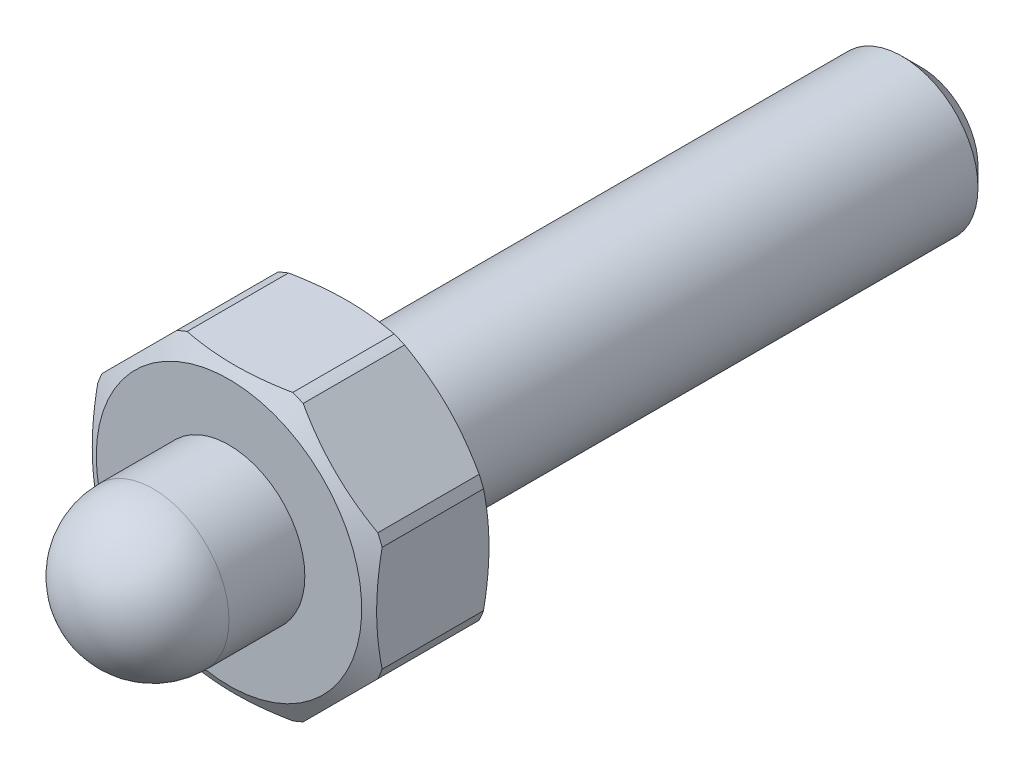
ISO-10303-21;
HEADER;
FILE_DESCRIPTION(('STEP AP214'),'2;1');
FILE_NAME('part.step','',(''),(''),'','','');
FILE_SCHEMA(('AUTOMOTIVE_DESIGN { 1 0 10303 214 1 1 1 1 }'));
ENDSEC;
DATA;
#1=APPLICATION_CONTEXT('core data for automotive mechanical design processes');
#2=APPLICATION_PROTOCOL_DEFINITION('international standard','automotive_design',2000,#1);
#3=PRODUCT_CONTEXT('',#1,'mechanical');
#4=PRODUCT('Part','Part','',(#3));
#5=PRODUCT_RELATED_PRODUCT_CATEGORY('part','',(#4));
#6=PRODUCT_DEFINITION_FORMATION('','',#4);
#7=PRODUCT_DEFINITION_CONTEXT('part definition',#1,'design');
#8=PRODUCT_DEFINITION('design','',#6,#7);
#9=PRODUCT_DEFINITION_SHAPE('','',#8);
#10=(LENGTH_UNIT() NAMED_UNIT(*) SI_UNIT(.MILLI.,.METRE.));
#11=(NAMED_UNIT(*) PLANE_ANGLE_UNIT() SI_UNIT($,.RADIAN.));
#12=(NAMED_UNIT(*) SI_UNIT($,.STERADIAN.) SOLID_ANGLE_UNIT());
#13=UNCERTAINTY_MEASURE_WITH_UNIT(LENGTH_MEASURE(1.E-05),#10,'distance_accuracy_value','');
#14=(GEOMETRIC_REPRESENTATION_CONTEXT(3) GLOBAL_UNCERTAINTY_ASSIGNED_CONTEXT((#13)) GLOBAL_UNIT_ASSIGNED_CONTEXT((#10,
#11,#12)) REPRESENTATION_CONTEXT('',''));
#15=CARTESIAN_POINT('',(0.,0.,0.));
#16=DIRECTION('',(0.,0.,1.));
#17=DIRECTION('',(1.,0.,0.));
#18=AXIS2_PLACEMENT_3D('',#15,#16,#17);
#19=CARTESIAN_POINT('',(-15.,6.21320343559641,73.));
#20=DIRECTION('',(-0.707106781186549,0.707106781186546,0.));
#21=DIRECTION('',(-0.707106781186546,-0.707106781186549,0.));
#22=AXIS2_PLACEMENT_3D('',#19,#20,#21);
#23=PLANE('',#22);
#24=CARTESIAN_POINT('',(-14.5438056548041,6.66939778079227,61.1547573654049));
#25=CARTESIAN_POINT('',(-14.2902564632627,6.92294697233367,61.082690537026));
#26=CARTESIAN_POINT('',(-14.0358395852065,7.17736385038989,61.0165370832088));
#27=CARTESIAN_POINT('',(-13.5254442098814,7.68775922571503,60.8970750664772));
#28=CARTESIAN_POINT('',(-13.269465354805,7.94373808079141,60.84376956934));
#29=CARTESIAN_POINT('',(-12.7561254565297,8.45707797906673,60.7510361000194));
#30=CARTESIAN_POINT('',(-12.4987638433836,8.71443959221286,60.7116143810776));
#31=CARTESIAN_POINT('',(-11.9831424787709,9.23006095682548,60.6475016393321));
#32=CARTESIAN_POINT('',(-11.7248828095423,9.48832062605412,60.6228093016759));
#33=CARTESIAN_POINT('',(-11.2119013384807,10.0013020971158,60.5889686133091));
#34=CARTESIAN_POINT('',(-10.9571874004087,10.2560160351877,60.5795831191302));
#35=CARTESIAN_POINT('',(-10.447691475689,10.7655119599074,60.5758244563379));
#36=CARTESIAN_POINT('',(-10.1929094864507,11.0202939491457,60.5814519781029));
#37=CARTESIAN_POINT('',(-9.68388083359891,11.5293226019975,60.6075861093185));
#38=CARTESIAN_POINT('',(-9.42963394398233,11.7835694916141,60.6280840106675));
#39=CARTESIAN_POINT('',(-8.92195224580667,12.2912511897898,60.6835005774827));
#40=CARTESIAN_POINT('',(-8.66851735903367,12.5446860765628,60.7184178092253));
#41=CARTESIAN_POINT('',(-8.269575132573,12.9436283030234,60.7843093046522));
#42=CARTESIAN_POINT('',(-8.12368179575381,13.0895216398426,60.8107228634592));
#43=CARTESIAN_POINT('',(-7.83234301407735,13.3808604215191,60.8679445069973));
#44=CARTESIAN_POINT('',(-7.68689751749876,13.5263059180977,60.898752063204));
#45=CARTESIAN_POINT('',(-7.3958078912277,13.8173955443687,60.9647314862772));
#46=CARTESIAN_POINT('',(-7.25016600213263,13.9630374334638,60.9999230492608));
#47=CARTESIAN_POINT('',(-6.95939007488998,14.2538133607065,61.0743548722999));
#48=CARTESIAN_POINT('',(-6.81425607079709,14.3989473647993,61.113595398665));
#49=CARTESIAN_POINT('',(-6.66939778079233,14.5438056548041,61.1547573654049));
#50=B_SPLINE_CURVE_WITH_KNOTS('',3,(#24,#25,#26,#27,#28,#29,#30,#31,#32,#33,#34,#35,#36,#37,#38,
#39,#40,#41,#42,#43,#44,#45,#46,#47,#48,#49),.UNSPECIFIED.,.F.,.F.,(4,2,2,2,2,2,2,2,2,2,2,2,4),
(0.,1.0972360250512,2.19473361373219,3.29272488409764,4.39061812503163,5.47133470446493,
6.55210098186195,7.63223487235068,8.71226139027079,9.33624446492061,9.96015254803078,
10.586972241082,11.2138331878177),.UNSPECIFIED.);
#51=CARTESIAN_POINT('',(-14.5436056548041,6.66959778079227,61.1547005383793));
#52=VERTEX_POINT('',#51);
#53=CARTESIAN_POINT('',(-6.66959778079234,14.5436056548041,61.1547005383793));
#54=VERTEX_POINT('',#53);
#55=EDGE_CURVE('E127',#52,#54,#50,.T.);
#56=ORIENTED_EDGE('',*,*,#55,.F.);
#57=DIRECTION('',(0.,0.,1.));
#58=VECTOR('',#57,1.);
#59=CARTESIAN_POINT('',(-14.5436056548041,6.66959778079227,76.7476041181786));
#60=LINE('',#59,#58);
#61=CARTESIAN_POINT('',(-14.5436056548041,6.66959778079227,71.8452994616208));
#62=VERTEX_POINT('',#61);
#63=EDGE_CURVE('E36',#52,#62,#60,.T.);
#64=ORIENTED_EDGE('',*,*,#63,.T.);
#65=CARTESIAN_POINT('',(-6.66939778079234,14.5438056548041,71.8452426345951));
#66=CARTESIAN_POINT('',(-6.92294697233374,14.2902564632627,71.917309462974));
#67=CARTESIAN_POINT('',(-7.17736385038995,14.0358395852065,71.9834629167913));
#68=CARTESIAN_POINT('',(-7.68775922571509,13.5254442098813,72.1029249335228));
#69=CARTESIAN_POINT('',(-7.94373808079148,13.269465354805,72.15623043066));
#70=CARTESIAN_POINT('',(-8.4570779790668,12.7561254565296,72.2489638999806));
#71=CARTESIAN_POINT('',(-8.71443959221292,12.4987638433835,72.2883856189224));
#72=CARTESIAN_POINT('',(-9.23006095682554,11.9831424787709,72.3524983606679));
#73=CARTESIAN_POINT('',(-9.48832062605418,11.7248828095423,72.3771906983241));
#74=CARTESIAN_POINT('',(-10.0013020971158,11.2119013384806,72.4110313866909));
#75=CARTESIAN_POINT('',(-10.2560160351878,10.9571874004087,72.4204168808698));
#76=CARTESIAN_POINT('',(-10.7655119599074,10.447691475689,72.4241755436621));
#77=CARTESIAN_POINT('',(-11.0202939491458,10.1929094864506,72.4185480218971));
#78=CARTESIAN_POINT('',(-11.5293226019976,9.68388083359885,72.3924138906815));
#79=CARTESIAN_POINT('',(-11.7835694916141,9.42963394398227,72.3719159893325));
#80=CARTESIAN_POINT('',(-12.2912511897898,8.92195224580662,72.3164994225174));
#81=CARTESIAN_POINT('',(-12.5446860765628,8.66851735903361,72.2815821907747));
#82=CARTESIAN_POINT('',(-12.9436283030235,8.26957513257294,72.2156906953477));
#83=CARTESIAN_POINT('',(-13.0895216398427,8.12368179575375,72.1892771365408));
#84=CARTESIAN_POINT('',(-13.3808604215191,7.83234301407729,72.1320554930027));
#85=CARTESIAN_POINT('',(-13.5263059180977,7.6868975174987,72.101247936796));
#86=CARTESIAN_POINT('',(-13.8173955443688,7.39580789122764,72.0352685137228));
#87=CARTESIAN_POINT('',(-13.9630374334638,7.25016600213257,72.0000769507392));
#88=CARTESIAN_POINT('',(-14.2538133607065,6.95939007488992,71.9256451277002));
#89=CARTESIAN_POINT('',(-14.3989473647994,6.81425607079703,71.886404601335));
#90=CARTESIAN_POINT('',(-14.5438056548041,6.66939778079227,71.8452426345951));
#91=B_SPLINE_CURVE_WITH_KNOTS('',3,(#65,#66,#67,#68,#69,#70,#71,#72,#73,#74,#75,#76,#77,#78,#79,
#80,#81,#82,#83,#84,#85,#86,#87,#88,#89,#90),.UNSPECIFIED.,.F.,.F.,(4,2,2,2,2,2,2,2,2,2,2,2,4),
(0.,1.0972360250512,2.19473361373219,3.29272488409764,4.39061812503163,5.47133470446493,
6.55210098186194,7.63223487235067,8.71226139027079,9.3362444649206,9.96015254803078,
10.586972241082,11.2138331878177),.UNSPECIFIED.);
#92=CARTESIAN_POINT('',(-6.66959778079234,14.5436056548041,71.8452994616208));
#93=VERTEX_POINT('',#92);
#94=EDGE_CURVE('E165',#93,#62,#91,.T.);
#95=ORIENTED_EDGE('',*,*,#94,.F.);
#96=DIRECTION('',(0.,0.,1.));
#97=VECTOR('',#96,1.);
#98=CARTESIAN_POINT('',(-6.66959778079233,14.5436056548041,76.7476041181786));
#99=LINE('',#98,#97);
#100=EDGE_CURVE('E133',#93,#54,#99,.F.);
#101=ORIENTED_EDGE('',*,*,#100,.T.);
#102=EDGE_LOOP('',(#56,#64,#95,#101));
#103=FACE_BOUND('',#102,.T.);
#104=ADVANCED_FACE('F14',(#103),#23,.T.);
#105=CARTESIAN_POINT('',(-15.,6.21320343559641,73.));
#106=DIRECTION('',(1.,0.,0.));
#107=DIRECTION('',(0.,1.,0.));
#108=AXIS2_PLACEMENT_3D('',#105,#106,#107);
#109=PLANE('',#108);
#110=DIRECTION('',(0.,0.,1.));
#111=VECTOR('',#110,1.);
#112=CARTESIAN_POINT('',(-15.,5.56776436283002,76.7476041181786));
#113=LINE('',#112,#111);
#114=CARTESIAN_POINT('',(-15.,5.56776436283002,61.1547005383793));
#115=VERTEX_POINT('',#114);
#116=CARTESIAN_POINT('',(-15.,5.56776436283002,71.8452994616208));
#117=VERTEX_POINT('',#116);
#118=EDGE_CURVE('E140',#115,#117,#113,.T.);
#119=ORIENTED_EDGE('',*,*,#118,.F.);
#120=CARTESIAN_POINT('',(-15.,-18.0892363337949,65.4844648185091));
#121=CARTESIAN_POINT('',(-15.,-17.8116810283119,65.3611140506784));
#122=CARTESIAN_POINT('',(-15.,-17.5336992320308,65.2387237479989));
#123=CARTESIAN_POINT('',(-15.,-16.9768041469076,64.996067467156));
#124=CARTESIAN_POINT('',(-15.,-16.697890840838,64.8758015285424));
#125=CARTESIAN_POINT('',(-15.,-15.8595196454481,64.5184460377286));
#126=CARTESIAN_POINT('',(-15.,-15.2985612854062,64.2848571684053));
#127=CARTESIAN_POINT('',(-15.,-14.1687209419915,63.8277256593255));
#128=CARTESIAN_POINT('',(-15.,-13.5998117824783,63.6042499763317));
#129=CARTESIAN_POINT('',(-15.,-12.4566492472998,63.1714562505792));
#130=CARTESIAN_POINT('',(-15.,-11.8823962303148,62.9621372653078));
#131=CARTESIAN_POINT('',(-15.,-10.7351471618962,62.5634761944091));
#132=CARTESIAN_POINT('',(-15.,-10.1622281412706,62.3739137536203));
#133=CARTESIAN_POINT('',(-15.,-9.00981169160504,62.0156276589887));
#134=CARTESIAN_POINT('',(-15.,-8.43031381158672,61.846905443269));
#135=CARTESIAN_POINT('',(-15.,-7.26572808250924,61.5352257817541));
#136=CARTESIAN_POINT('',(-15.,-6.6806552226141,61.3922128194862));
#137=CARTESIAN_POINT('',(-15.,-5.50392224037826,61.136577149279));
#138=CARTESIAN_POINT('',(-15.,-4.91226366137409,61.0239474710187));
#139=CARTESIAN_POINT('',(-15.,-3.96829591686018,60.8731823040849));
#140=CARTESIAN_POINT('',(-15.,-3.61781573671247,60.8234741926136));
#141=CARTESIAN_POINT('',(-15.,-2.91525380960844,60.7371674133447));
#142=CARTESIAN_POINT('',(-15.,-2.56317218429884,60.7005677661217));
#143=CARTESIAN_POINT('',(-15.,-1.85778063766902,60.6411928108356));
#144=CARTESIAN_POINT('',(-15.,-1.50447052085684,60.6184198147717));
#145=CARTESIAN_POINT('',(-15.,-0.797210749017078,60.5871834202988));
#146=CARTESIAN_POINT('',(-15.,-0.44326108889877,60.578720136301));
#147=CARTESIAN_POINT('',(-15.,0.265341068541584,60.5762850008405));
#148=CARTESIAN_POINT('',(-15.,0.619993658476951,60.5823398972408));
#149=CARTESIAN_POINT('',(-15.,1.32875303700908,60.6088647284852));
#150=CARTESIAN_POINT('',(-15.,1.68285982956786,60.6293345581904));
#151=CARTESIAN_POINT('',(-15.,2.38986972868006,60.6842469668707));
#152=CARTESIAN_POINT('',(-15.,2.74277317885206,60.7186851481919));
#153=CARTESIAN_POINT('',(-15.,3.44705319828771,60.8008491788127));
#154=CARTESIAN_POINT('',(-15.,3.79842961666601,60.8485763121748));
#155=CARTESIAN_POINT('',(-15.,4.53163445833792,60.9614238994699));
#156=CARTESIAN_POINT('',(-15.,4.91327792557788,61.0277437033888));
#157=CARTESIAN_POINT('',(-15.,5.67398153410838,61.1739024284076));
#158=CARTESIAN_POINT('',(-15.,6.05304140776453,61.2537427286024));
#159=CARTESIAN_POINT('',(-15.,7.18633308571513,61.5115546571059));
#160=CARTESIAN_POINT('',(-15.,7.93643940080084,61.707779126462));
#161=CARTESIAN_POINT('',(-15.,9.42834093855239,62.1392057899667));
#162=CARTESIAN_POINT('',(-15.,10.1700911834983,62.3745600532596));
#163=CARTESIAN_POINT('',(-15.,11.6433522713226,62.8747852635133));
#164=CARTESIAN_POINT('',(-15.,12.3748646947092,63.1396515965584));
#165=CARTESIAN_POINT('',(-15.,13.8358030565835,63.6945342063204));
#166=CARTESIAN_POINT('',(-15.,14.5651500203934,63.9847566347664));
#167=CARTESIAN_POINT('',(-15.,16.0165603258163,64.5829556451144));
#168=CARTESIAN_POINT('',(-15.,16.7386230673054,64.8909336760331));
#169=CARTESIAN_POINT('',(-15.,17.8135860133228,65.3616778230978));
#170=CARTESIAN_POINT('',(-15.,18.1687817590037,65.5192396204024));
#171=CARTESIAN_POINT('',(-15.,18.8778252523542,65.8373745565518));
#172=CARTESIAN_POINT('',(-15.,19.231672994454,65.997947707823));
#173=CARTESIAN_POINT('',(-15.,19.9380403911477,66.3217173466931));
#174=CARTESIAN_POINT('',(-15.,20.2905604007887,66.4849130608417));
#175=CARTESIAN_POINT('',(-15.,20.9944788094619,66.8136899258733));
#176=CARTESIAN_POINT('',(-15.,21.3458772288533,66.9792710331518));
#177=CARTESIAN_POINT('',(-15.,21.6967730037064,67.1459061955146));
#178=B_SPLINE_CURVE_WITH_KNOTS('',3,(#120,#121,#122,#123,#124,#125,#126,#127,#128,#129,#130,
#131,#132,#133,#134,#135,#136,#137,#138,#139,#140,#141,#142,#143,#144,#145,#146,#147,#148,#149,
#150,#151,#152,#153,#154,#155,#156,#157,#158,#159,#160,#161,#162,#163,#164,#165,#166,#167,#168,
#169,#170,#171,#172,#173,#174,#175,#176,#177),.UNSPECIFIED.,.F.,.F.,(4,2,2,2,2,2,2,2,2,2,2,2,2,
2,2,2,2,2,2,2,2,2,2,2,2,2,2,2,4),(0.,0.911188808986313,1.8223945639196,3.64523572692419,
5.47876793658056,7.31217795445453,9.12225242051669,10.9324517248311,12.7386938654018,
14.5445212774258,15.6062717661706,16.6679429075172,17.7297915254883,18.7916486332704,
19.8554635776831,20.9192707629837,21.9827432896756,23.0463186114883,24.2081298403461,
25.3700596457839,27.6946395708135,30.0284741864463,32.3619444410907,34.7165598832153,
37.0713677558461,38.2370794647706,39.4027959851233,40.5681748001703,41.7335323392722),.UNSPECIFIED.);
#179=CARTESIAN_POINT('',(-15.,-5.56776436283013,61.1547005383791));
#180=VERTEX_POINT('',#179);
#181=EDGE_CURVE('E28',#115,#180,#178,.F.);
#182=ORIENTED_EDGE('',*,*,#181,.T.);
#183=DIRECTION('',(0.,0.,1.));
#184=VECTOR('',#183,1.);
#185=CARTESIAN_POINT('',(-15.,-5.56776436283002,76.7476041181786));
#186=LINE('',#185,#184);
#187=CARTESIAN_POINT('',(-15.,-5.56776436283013,71.8452994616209));
#188=VERTEX_POINT('',#187);
#189=EDGE_CURVE('E170',#188,#180,#186,.F.);
#190=ORIENTED_EDGE('',*,*,#189,.F.);
#191=CARTESIAN_POINT('',(-15.,-18.0892363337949,67.5155351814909));
#192=CARTESIAN_POINT('',(-15.,-17.811681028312,67.6388859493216));
#193=CARTESIAN_POINT('',(-15.,-17.5336992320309,67.7612762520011));
#194=CARTESIAN_POINT('',(-15.,-16.9768041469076,68.0039325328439));
#195=CARTESIAN_POINT('',(-15.,-16.6978908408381,68.1241984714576));
#196=CARTESIAN_POINT('',(-15.,-15.8595196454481,68.4815539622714));
#197=CARTESIAN_POINT('',(-15.,-15.2985612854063,68.7151428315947));
#198=CARTESIAN_POINT('',(-15.,-14.1687209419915,69.1722743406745));
#199=CARTESIAN_POINT('',(-15.,-13.5998117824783,69.3957500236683));
#200=CARTESIAN_POINT('',(-15.,-12.4566492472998,69.8285437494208));
#201=CARTESIAN_POINT('',(-15.,-11.8823962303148,70.0378627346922));
#202=CARTESIAN_POINT('',(-15.,-10.7351471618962,70.4365238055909));
#203=CARTESIAN_POINT('',(-15.,-10.1622281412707,70.6260862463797));
#204=CARTESIAN_POINT('',(-15.,-9.00981169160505,70.9843723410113));
#205=CARTESIAN_POINT('',(-15.,-8.43031381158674,71.153094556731));
#206=CARTESIAN_POINT('',(-15.,-7.26572808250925,71.4647742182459));
#207=CARTESIAN_POINT('',(-15.,-6.68065522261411,71.6077871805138));
#208=CARTESIAN_POINT('',(-15.,-5.50392224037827,71.863422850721));
#209=CARTESIAN_POINT('',(-15.,-4.9122636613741,71.9760525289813));
#210=CARTESIAN_POINT('',(-15.,-3.96829591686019,72.1268176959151));
#211=CARTESIAN_POINT('',(-15.,-3.61781573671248,72.1765258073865));
#212=CARTESIAN_POINT('',(-15.,-2.91525380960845,72.2628325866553));
#213=CARTESIAN_POINT('',(-15.,-2.56317218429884,72.2994322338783));
#214=CARTESIAN_POINT('',(-15.,-1.85778063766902,72.3588071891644));
#215=CARTESIAN_POINT('',(-15.,-1.50447052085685,72.3815801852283));
#216=CARTESIAN_POINT('',(-15.,-0.797210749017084,72.4128165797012));
#217=CARTESIAN_POINT('',(-15.,-0.443261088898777,72.421279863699));
#218=CARTESIAN_POINT('',(-15.,0.265341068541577,72.4237149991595));
#219=CARTESIAN_POINT('',(-15.,0.619993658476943,72.4176601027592));
#220=CARTESIAN_POINT('',(-15.,1.32875303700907,72.3911352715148));
#221=CARTESIAN_POINT('',(-15.,1.68285982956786,72.3706654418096));
#222=CARTESIAN_POINT('',(-15.,2.38986972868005,72.3157530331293));
#223=CARTESIAN_POINT('',(-15.,2.74277317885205,72.2813148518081));
#224=CARTESIAN_POINT('',(-15.,3.4470531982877,72.1991508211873));
#225=CARTESIAN_POINT('',(-15.,3.798429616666,72.1514236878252));
#226=CARTESIAN_POINT('',(-15.,4.53163445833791,72.0385761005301));
#227=CARTESIAN_POINT('',(-15.,4.91327792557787,71.9722562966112));
#228=CARTESIAN_POINT('',(-15.,5.67398153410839,71.8260975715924));
#229=CARTESIAN_POINT('',(-15.,6.05304140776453,71.7462572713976));
#230=CARTESIAN_POINT('',(-15.,7.18633308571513,71.4884453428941));
#231=CARTESIAN_POINT('',(-15.,7.93643940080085,71.292220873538));
#232=CARTESIAN_POINT('',(-15.,9.42834093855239,70.8607942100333));
#233=CARTESIAN_POINT('',(-15.,10.1700911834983,70.6254399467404));
#234=CARTESIAN_POINT('',(-15.,11.6433522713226,70.1252147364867));
#235=CARTESIAN_POINT('',(-15.,12.3748646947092,69.8603484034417));
#236=CARTESIAN_POINT('',(-15.,13.8358030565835,69.3054657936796));
#237=CARTESIAN_POINT('',(-15.,14.5651500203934,69.0152433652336));
#238=CARTESIAN_POINT('',(-15.,16.0165603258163,68.4170443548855));
#239=CARTESIAN_POINT('',(-15.,16.7386230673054,68.1090663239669));
#240=CARTESIAN_POINT('',(-15.,17.8135860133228,67.6383221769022));
#241=CARTESIAN_POINT('',(-15.,18.1687817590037,67.4807603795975));
#242=CARTESIAN_POINT('',(-15.,18.8778252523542,67.1626254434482));
#243=CARTESIAN_POINT('',(-15.,19.231672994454,67.002052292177));
#244=CARTESIAN_POINT('',(-15.,19.9380403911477,66.6782826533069));
#245=CARTESIAN_POINT('',(-15.,20.2905604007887,66.5150869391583));
#246=CARTESIAN_POINT('',(-15.,20.9944788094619,66.1863100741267));
#247=CARTESIAN_POINT('',(-15.,21.3458772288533,66.0207289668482));
#248=CARTESIAN_POINT('',(-15.,21.6967730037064,65.8540938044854));
#249=B_SPLINE_CURVE_WITH_KNOTS('',3,(#191,#192,#193,#194,#195,#196,#197,#198,#199,#200,#201,
#202,#203,#204,#205,#206,#207,#208,#209,#210,#211,#212,#213,#214,#215,#216,#217,#218,#219,#220,
#221,#222,#223,#224,#225,#226,#227,#228,#229,#230,#231,#232,#233,#234,#235,#236,#237,#238,#239,
#240,#241,#242,#243,#244,#245,#246,#247,#248),.UNSPECIFIED.,.F.,.F.,(4,2,2,2,2,2,2,2,2,2,2,2,2,
2,2,2,2,2,2,2,2,2,2,2,2,2,2,2,4),(0.,0.911188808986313,1.8223945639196,3.64523572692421,
5.47876793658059,7.31217795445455,9.12225242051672,10.9324517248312,12.7386938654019,
14.5445212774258,15.6062717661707,16.6679429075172,17.7297915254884,18.7916486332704,
19.8554635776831,20.9192707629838,21.9827432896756,23.0463186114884,24.2081298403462,
25.370059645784,27.6946395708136,30.0284741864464,32.3619444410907,34.7165598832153,
37.0713677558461,38.2370794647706,39.4027959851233,40.5681748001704,41.7335323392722),.UNSPECIFIED.);
#250=EDGE_CURVE('E163',#188,#117,#249,.T.);
#251=ORIENTED_EDGE('',*,*,#250,.T.);
#252=EDGE_LOOP('',(#119,#182,#190,#251));
#253=FACE_BOUND('',#252,.T.);
#254=ADVANCED_FACE('F168',(#253),#109,.F.);
#255=CARTESIAN_POINT('',(-15.,-6.21320343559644,73.));
#256=DIRECTION('',(0.707106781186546,0.707106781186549,0.));
#257=DIRECTION('',(-0.707106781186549,0.707106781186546,0.));
#258=AXIS2_PLACEMENT_3D('',#255,#256,#257);
#259=PLANE('',#258);
#260=DIRECTION('',(0.,0.,1.));
#261=VECTOR('',#260,1.);
#262=CARTESIAN_POINT('',(-14.5436056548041,-6.66959778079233,76.7476041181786));
#263=LINE('',#262,#261);
#264=CARTESIAN_POINT('',(-14.5436056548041,-6.66959778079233,61.1547005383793));
#265=VERTEX_POINT('',#264);
#266=CARTESIAN_POINT('',(-14.5436056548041,-6.66959778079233,71.8452994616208));
#267=VERTEX_POINT('',#266);
#268=EDGE_CURVE('E336',#265,#267,#263,.T.);
#269=ORIENTED_EDGE('',*,*,#268,.F.);
#270=CARTESIAN_POINT('',(-14.5438056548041,-6.66939778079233,61.1547573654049));
#271=CARTESIAN_POINT('',(-14.2902564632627,-6.92294697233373,61.082690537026));
#272=CARTESIAN_POINT('',(-14.0358395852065,-7.17736385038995,61.0165370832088));
#273=CARTESIAN_POINT('',(-13.5254442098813,-7.68775922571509,60.8970750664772));
#274=CARTESIAN_POINT('',(-13.269465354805,-7.94373808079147,60.84376956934));
#275=CARTESIAN_POINT('',(-12.7561254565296,-8.45707797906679,60.7510361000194));
#276=CARTESIAN_POINT('',(-12.4987638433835,-8.71443959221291,60.7116143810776));
#277=CARTESIAN_POINT('',(-11.9831424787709,-9.23006095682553,60.6475016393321));
#278=CARTESIAN_POINT('',(-11.7248828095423,-9.48832062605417,60.6228093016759));
#279=CARTESIAN_POINT('',(-11.2119013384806,-10.0013020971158,60.5889686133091));
#280=CARTESIAN_POINT('',(-10.9571874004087,-10.2560160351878,60.5795831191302));
#281=CARTESIAN_POINT('',(-10.447691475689,-10.7655119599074,60.5758244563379));
#282=CARTESIAN_POINT('',(-10.1929094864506,-11.0202939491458,60.5814519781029));
#283=CARTESIAN_POINT('',(-9.68388083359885,-11.5293226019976,60.6075861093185));
#284=CARTESIAN_POINT('',(-9.42963394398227,-11.7835694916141,60.6280840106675));
#285=CARTESIAN_POINT('',(-8.92195224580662,-12.2912511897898,60.6835005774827));
#286=CARTESIAN_POINT('',(-8.66851735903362,-12.5446860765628,60.7184178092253));
#287=CARTESIAN_POINT('',(-8.26957513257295,-12.9436283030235,60.7843093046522));
#288=CARTESIAN_POINT('',(-8.12368179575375,-13.0895216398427,60.8107228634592));
#289=CARTESIAN_POINT('',(-7.83234301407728,-13.3808604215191,60.8679445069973));
#290=CARTESIAN_POINT('',(-7.6868975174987,-13.5263059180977,60.898752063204));
#291=CARTESIAN_POINT('',(-7.39580789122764,-13.8173955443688,60.9647314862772));
#292=CARTESIAN_POINT('',(-7.25016600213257,-13.9630374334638,60.9999230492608));
#293=CARTESIAN_POINT('',(-6.95939007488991,-14.2538133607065,61.0743548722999));
#294=CARTESIAN_POINT('',(-6.81425607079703,-14.3989473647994,61.113595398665));
#295=CARTESIAN_POINT('',(-6.66939778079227,-14.5438056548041,61.1547573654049));
#296=B_SPLINE_CURVE_WITH_KNOTS('',3,(#270,#271,#272,#273,#274,#275,#276,#277,#278,#279,#280,
#281,#282,#283,#284,#285,#286,#287,#288,#289,#290,#291,#292,#293,#294,#295),.UNSPECIFIED.,.F.,
.F.,(4,2,2,2,2,2,2,2,2,2,2,2,4),(0.,1.0972360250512,2.19473361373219,3.29272488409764,
4.39061812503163,5.47133470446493,6.55210098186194,7.63223487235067,8.71226139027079,
9.33624446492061,9.96015254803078,10.586972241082,11.2138331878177),.UNSPECIFIED.);
#297=CARTESIAN_POINT('',(-6.66959778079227,-14.5436056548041,61.1547005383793));
#298=VERTEX_POINT('',#297);
#299=EDGE_CURVE('E388',#265,#298,#296,.T.);
#300=ORIENTED_EDGE('',*,*,#299,.T.);
#301=DIRECTION('',(0.,0.,1.));
#302=VECTOR('',#301,1.);
#303=CARTESIAN_POINT('',(-6.66959778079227,-14.5436056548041,76.7476041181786));
#304=LINE('',#303,#302);
#305=CARTESIAN_POINT('',(-6.66959778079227,-14.5436056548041,71.8452994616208));
#306=VERTEX_POINT('',#305);
#307=EDGE_CURVE('E338',#306,#298,#304,.F.);
#308=ORIENTED_EDGE('',*,*,#307,.F.);
#309=CARTESIAN_POINT('',(-6.66939778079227,-14.5438056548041,71.8452426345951));
#310=CARTESIAN_POINT('',(-6.92294697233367,-14.2902564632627,71.917309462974));
#311=CARTESIAN_POINT('',(-7.17736385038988,-14.0358395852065,71.9834629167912));
#312=CARTESIAN_POINT('',(-7.68775922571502,-13.5254442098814,72.1029249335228));
#313=CARTESIAN_POINT('',(-7.9437380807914,-13.269465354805,72.15623043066));
#314=CARTESIAN_POINT('',(-8.45707797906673,-12.7561254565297,72.2489638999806));
#315=CARTESIAN_POINT('',(-8.71443959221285,-12.4987638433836,72.2883856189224));
#316=CARTESIAN_POINT('',(-9.23006095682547,-11.9831424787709,72.3524983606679));
#317=CARTESIAN_POINT('',(-9.48832062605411,-11.7248828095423,72.3771906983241));
#318=CARTESIAN_POINT('',(-10.0013020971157,-11.2119013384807,72.4110313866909));
#319=CARTESIAN_POINT('',(-10.2560160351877,-10.9571874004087,72.4204168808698));
#320=CARTESIAN_POINT('',(-10.7655119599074,-10.4476914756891,72.4241755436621));
#321=CARTESIAN_POINT('',(-11.0202939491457,-10.1929094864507,72.4185480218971));
#322=CARTESIAN_POINT('',(-11.5293226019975,-9.68388083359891,72.3924138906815));
#323=CARTESIAN_POINT('',(-11.7835694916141,-9.42963394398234,72.3719159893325));
#324=CARTESIAN_POINT('',(-12.2912511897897,-8.92195224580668,72.3164994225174));
#325=CARTESIAN_POINT('',(-12.5446860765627,-8.66851735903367,72.2815821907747));
#326=CARTESIAN_POINT('',(-12.9436283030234,-8.269575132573,72.2156906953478));
#327=CARTESIAN_POINT('',(-13.0895216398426,-8.12368179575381,72.1892771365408));
#328=CARTESIAN_POINT('',(-13.3808604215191,-7.83234301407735,72.1320554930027));
#329=CARTESIAN_POINT('',(-13.5263059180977,-7.68689751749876,72.101247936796));
#330=CARTESIAN_POINT('',(-13.8173955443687,-7.3958078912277,72.0352685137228));
#331=CARTESIAN_POINT('',(-13.9630374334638,-7.25016600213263,72.0000769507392));
#332=CARTESIAN_POINT('',(-14.2538133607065,-6.95939007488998,71.9256451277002));
#333=CARTESIAN_POINT('',(-14.3989473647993,-6.81425607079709,71.886404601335));
#334=CARTESIAN_POINT('',(-14.5438056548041,-6.66939778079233,71.8452426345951));
#335=B_SPLINE_CURVE_WITH_KNOTS('',3,(#309,#310,#311,#312,#313,#314,#315,#316,#317,#318,#319,
#320,#321,#322,#323,#324,#325,#326,#327,#328,#329,#330,#331,#332,#333,#334),.UNSPECIFIED.,.F.,
.F.,(4,2,2,2,2,2,2,2,2,2,2,2,4),(0.,1.09723602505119,2.19473361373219,3.29272488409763,
4.39061812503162,5.47133470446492,6.55210098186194,7.63223487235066,8.71226139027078,
9.3362444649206,9.96015254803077,10.586972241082,11.2138331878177),.UNSPECIFIED.);
#336=EDGE_CURVE('E216',#306,#267,#335,.T.);
#337=ORIENTED_EDGE('',*,*,#336,.T.);
#338=EDGE_LOOP('',(#269,#300,#308,#337));
#339=FACE_BOUND('',#338,.T.);
#340=ADVANCED_FACE('F334',(#339),#259,.F.);
#341=CARTESIAN_POINT('',(6.21320343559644,-15.,73.));
#342=DIRECTION('',(0.,-1.,0.));
#343=DIRECTION('',(0.,0.,-1.));
#344=AXIS2_PLACEMENT_3D('',#341,#342,#343);
#345=PLANE('',#344);
#346=CARTESIAN_POINT('',(-18.0892363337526,-15.,65.4844648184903));
#347=CARTESIAN_POINT('',(-17.8116810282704,-15.,65.36111405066));
#348=CARTESIAN_POINT('',(-17.5336992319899,-15.,65.238723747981));
#349=CARTESIAN_POINT('',(-16.9768041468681,-15.,64.9960674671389));
#350=CARTESIAN_POINT('',(-16.6978908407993,-15.,64.8758015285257));
#351=CARTESIAN_POINT('',(-15.8595196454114,-15.,64.5184460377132));
#352=CARTESIAN_POINT('',(-15.2985612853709,-15.,64.2848571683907));
#353=CARTESIAN_POINT('',(-14.168720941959,-15.,63.8277256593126));
#354=CARTESIAN_POINT('',(-13.5998117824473,-15.,63.6042499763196));
#355=CARTESIAN_POINT('',(-12.4566492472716,-15.,63.1714562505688));
#356=CARTESIAN_POINT('',(-11.8823962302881,-15.,62.9621372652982));
#357=CARTESIAN_POINT('',(-10.7351471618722,-15.,62.5634761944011));
#358=CARTESIAN_POINT('',(-10.162228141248,-15.,62.373913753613));
#359=CARTESIAN_POINT('',(-9.00981169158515,-15.,62.0156276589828));
#360=CARTESIAN_POINT('',(-8.43031381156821,-15.,61.8469054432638));
#361=CARTESIAN_POINT('',(-7.26572808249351,-15.,61.5352257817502));
#362=CARTESIAN_POINT('',(-6.68065522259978,-15.,61.3922128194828));
#363=CARTESIAN_POINT('',(-5.50392224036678,-15.,61.1365771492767));
#364=CARTESIAN_POINT('',(-4.91226366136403,-15.,61.023947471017));
#365=CARTESIAN_POINT('',(-3.96829591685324,-15.,60.8731823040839));
#366=CARTESIAN_POINT('',(-3.61781573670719,-15.,60.8234741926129));
#367=CARTESIAN_POINT('',(-2.91525380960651,-15.,60.7371674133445));
#368=CARTESIAN_POINT('',(-2.56317218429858,-15.,60.7005677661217));
#369=CARTESIAN_POINT('',(-1.85778063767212,-15.,60.6411928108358));
#370=CARTESIAN_POINT('',(-1.50447052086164,-15.,60.618419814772));
#371=CARTESIAN_POINT('',(-0.797210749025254,-15.,60.5871834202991));
#372=CARTESIAN_POINT('',(-0.443261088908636,-15.,60.5787201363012));
#373=CARTESIAN_POINT('',(0.265341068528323,-15.,60.5762850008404));
#374=CARTESIAN_POINT('',(0.619993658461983,-15.,60.5823398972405));
#375=CARTESIAN_POINT('',(1.32875303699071,-15.,60.6088647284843));
#376=CARTESIAN_POINT('',(1.68285982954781,-15.,60.6293345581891));
#377=CARTESIAN_POINT('',(2.38986972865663,-15.,60.6842469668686));
#378=CARTESIAN_POINT('',(2.74277317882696,-15.,60.7186851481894));
#379=CARTESIAN_POINT('',(3.44705319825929,-15.,60.800849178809));
#380=CARTESIAN_POINT('',(3.79842961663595,-15.,60.8485763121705));
#381=CARTESIAN_POINT('',(4.53163445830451,-15.,60.9614238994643));
#382=CARTESIAN_POINT('',(4.91327792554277,-15.,61.0277437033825));
#383=CARTESIAN_POINT('',(5.67398153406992,-15.,61.1739024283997));
#384=CARTESIAN_POINT('',(6.0530414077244,-15.,61.2537427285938));
#385=CARTESIAN_POINT('',(7.18633308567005,-15.,61.5115546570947));
#386=CARTESIAN_POINT('',(7.93643940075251,-15.,61.7077791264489));
#387=CARTESIAN_POINT('',(9.42834093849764,-15.,62.1392057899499));
#388=CARTESIAN_POINT('',(10.1700911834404,-15.,62.3745600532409));
#389=CARTESIAN_POINT('',(11.6433522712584,-15.,62.8747852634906));
#390=CARTESIAN_POINT('',(12.3748646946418,-15.,63.1396515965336));
#391=CARTESIAN_POINT('',(13.83580305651,-15.,63.6945342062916));
#392=CARTESIAN_POINT('',(14.5651500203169,-15.,63.9847566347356));
#393=CARTESIAN_POINT('',(16.0165603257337,-15.,64.5829556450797));
#394=CARTESIAN_POINT('',(16.7386230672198,-15.,64.8909336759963));
#395=CARTESIAN_POINT('',(17.8135860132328,-15.,65.361677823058));
#396=CARTESIAN_POINT('',(18.1687817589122,-15.,65.5192396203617));
#397=CARTESIAN_POINT('',(18.8778252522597,-15.,65.8373745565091));
#398=CARTESIAN_POINT('',(19.231672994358,-15.,65.9979477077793));
#399=CARTESIAN_POINT('',(19.9380403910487,-15.,66.3217173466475));
#400=CARTESIAN_POINT('',(20.2905604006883,-15.,66.4849130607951));
#401=CARTESIAN_POINT('',(20.9944788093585,-15.,66.8136899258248));
#402=CARTESIAN_POINT('',(21.3458772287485,-15.,66.9792710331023));
#403=CARTESIAN_POINT('',(21.6967730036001,-15.,67.1459061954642));
#404=B_SPLINE_CURVE_WITH_KNOTS('',3,(#346,#347,#348,#349,#350,#351,#352,#353,#354,#355,#356,
#357,#358,#359,#360,#361,#362,#363,#364,#365,#366,#367,#368,#369,#370,#371,#372,#373,#374,#375,
#376,#377,#378,#379,#380,#381,#382,#383,#384,#385,#386,#387,#388,#389,#390,#391,#392,#393,#394,
#395,#396,#397,#398,#399,#400,#401,#402,#403),.UNSPECIFIED.,.F.,.F.,(4,2,2,2,2,2,2,2,2,2,2,2,2,
2,2,2,2,2,2,2,2,2,2,2,2,2,2,2,4),(0.,0.911188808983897,1.82239456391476,3.64523572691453,
5.47876793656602,7.31217795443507,9.1222524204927,10.9324517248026,12.7386938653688,
14.5445212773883,15.606271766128,16.6679429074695,17.7297915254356,18.7916486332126,
19.8554635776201,20.9192707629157,21.9827432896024,23.04631861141,24.2081298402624,
25.3700596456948,27.6946395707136,30.0284741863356,32.3619444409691,34.716559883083,
37.0713677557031,38.2370794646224,39.4027959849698,40.5681748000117,41.7335323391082),.UNSPECIFIED.);
#405=CARTESIAN_POINT('',(5.56776436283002,-15.,61.1547005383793));
#406=VERTEX_POINT('',#405);
#407=CARTESIAN_POINT('',(-5.56776436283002,-15.,61.1547005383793));
#408=VERTEX_POINT('',#407);
#409=EDGE_CURVE('E365',#406,#408,#404,.F.);
#410=ORIENTED_EDGE('',*,*,#409,.F.);
#411=DIRECTION('',(0.,0.,1.));
#412=VECTOR('',#411,1.);
#413=CARTESIAN_POINT('',(5.56776436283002,-15.,76.7476041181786));
#414=LINE('',#413,#412);
#415=CARTESIAN_POINT('',(5.56776436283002,-15.,71.8452994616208));
#416=VERTEX_POINT('',#415);
#417=EDGE_CURVE('E302',#406,#416,#414,.T.);
#418=ORIENTED_EDGE('',*,*,#417,.T.);
#419=CARTESIAN_POINT('',(-18.0892363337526,-15.,67.5155351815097));
#420=CARTESIAN_POINT('',(-17.8116810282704,-15.,67.63888594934));
#421=CARTESIAN_POINT('',(-17.5336992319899,-15.,67.7612762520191));
#422=CARTESIAN_POINT('',(-16.9768041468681,-15.,68.0039325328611));
#423=CARTESIAN_POINT('',(-16.6978908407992,-15.,68.1241984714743));
#424=CARTESIAN_POINT('',(-15.8595196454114,-15.,68.4815539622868));
#425=CARTESIAN_POINT('',(-15.2985612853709,-15.,68.7151428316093));
#426=CARTESIAN_POINT('',(-14.168720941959,-15.,69.1722743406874));
#427=CARTESIAN_POINT('',(-13.5998117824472,-15.,69.3957500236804));
#428=CARTESIAN_POINT('',(-12.4566492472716,-15.,69.8285437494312));
#429=CARTESIAN_POINT('',(-11.882396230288,-15.,70.0378627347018));
#430=CARTESIAN_POINT('',(-10.7351471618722,-15.,70.4365238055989));
#431=CARTESIAN_POINT('',(-10.162228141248,-15.,70.626086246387));
#432=CARTESIAN_POINT('',(-9.00981169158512,-15.,70.9843723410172));
#433=CARTESIAN_POINT('',(-8.43031381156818,-15.,71.1530945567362));
#434=CARTESIAN_POINT('',(-7.26572808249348,-15.,71.4647742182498));
#435=CARTESIAN_POINT('',(-6.68065522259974,-15.,71.6077871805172));
#436=CARTESIAN_POINT('',(-5.50392224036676,-15.,71.8634228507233));
#437=CARTESIAN_POINT('',(-4.91226366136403,-15.,71.9760525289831));
#438=CARTESIAN_POINT('',(-3.96829591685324,-15.,72.1268176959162));
#439=CARTESIAN_POINT('',(-3.61781573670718,-15.,72.1765258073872));
#440=CARTESIAN_POINT('',(-2.9152538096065,-15.,72.2628325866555));
#441=CARTESIAN_POINT('',(-2.56317218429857,-15.,72.2994322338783));
#442=CARTESIAN_POINT('',(-1.85778063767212,-15.,72.3588071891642));
#443=CARTESIAN_POINT('',(-1.50447052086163,-15.,72.381580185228));
#444=CARTESIAN_POINT('',(-0.79721074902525,-15.,72.4128165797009));
#445=CARTESIAN_POINT('',(-0.443261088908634,-15.,72.4212798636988));
#446=CARTESIAN_POINT('',(0.265341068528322,-15.,72.4237149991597));
#447=CARTESIAN_POINT('',(0.619993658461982,-15.,72.4176601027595));
#448=CARTESIAN_POINT('',(1.32875303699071,-15.,72.3911352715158));
#449=CARTESIAN_POINT('',(1.6828598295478,-15.,72.3706654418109));
#450=CARTESIAN_POINT('',(2.38986972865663,-15.,72.3157530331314));
#451=CARTESIAN_POINT('',(2.74277317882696,-15.,72.2813148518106));
#452=CARTESIAN_POINT('',(3.44705319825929,-15.,72.199150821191));
#453=CARTESIAN_POINT('',(3.79842961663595,-15.,72.1514236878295));
#454=CARTESIAN_POINT('',(4.53163445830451,-15.,72.0385761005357));
#455=CARTESIAN_POINT('',(4.91327792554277,-15.,71.9722562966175));
#456=CARTESIAN_POINT('',(5.67398153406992,-15.,71.8260975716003));
#457=CARTESIAN_POINT('',(6.0530414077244,-15.,71.7462572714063));
#458=CARTESIAN_POINT('',(7.18633308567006,-15.,71.4884453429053));
#459=CARTESIAN_POINT('',(7.93643940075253,-15.,71.2922208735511));
#460=CARTESIAN_POINT('',(9.42834093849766,-15.,70.8607942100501));
#461=CARTESIAN_POINT('',(10.1700911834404,-15.,70.6254399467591));
#462=CARTESIAN_POINT('',(11.6433522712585,-15.,70.1252147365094));
#463=CARTESIAN_POINT('',(12.3748646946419,-15.,69.8603484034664));
#464=CARTESIAN_POINT('',(13.8358030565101,-15.,69.3054657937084));
#465=CARTESIAN_POINT('',(14.5651500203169,-15.,69.0152433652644));
#466=CARTESIAN_POINT('',(16.0165603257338,-15.,68.4170443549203));
#467=CARTESIAN_POINT('',(16.7386230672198,-15.,68.1090663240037));
#468=CARTESIAN_POINT('',(17.8135860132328,-15.,67.638322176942));
#469=CARTESIAN_POINT('',(18.1687817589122,-15.,67.4807603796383));
#470=CARTESIAN_POINT('',(18.8778252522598,-15.,67.1626254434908));
#471=CARTESIAN_POINT('',(19.2316729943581,-15.,67.0020522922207));
#472=CARTESIAN_POINT('',(19.9380403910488,-15.,66.6782826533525));
#473=CARTESIAN_POINT('',(20.2905604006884,-15.,66.5150869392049));
#474=CARTESIAN_POINT('',(20.9944788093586,-15.,66.1863100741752));
#475=CARTESIAN_POINT('',(21.3458772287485,-15.,66.0207289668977));
#476=CARTESIAN_POINT('',(21.6967730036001,-15.,65.8540938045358));
#477=B_SPLINE_CURVE_WITH_KNOTS('',3,(#419,#420,#421,#422,#423,#424,#425,#426,#427,#428,#429,
#430,#431,#432,#433,#434,#435,#436,#437,#438,#439,#440,#441,#442,#443,#444,#445,#446,#447,#448,
#449,#450,#451,#452,#453,#454,#455,#456,#457,#458,#459,#460,#461,#462,#463,#464,#465,#466,#467,
#468,#469,#470,#471,#472,#473,#474,#475,#476),.UNSPECIFIED.,.F.,.F.,(4,2,2,2,2,2,2,2,2,2,2,2,2,
2,2,2,2,2,2,2,2,2,2,2,2,2,2,2,4),(0.,0.911188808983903,1.82239456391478,3.64523572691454,
5.47876793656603,7.31217795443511,9.12225242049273,10.9324517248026,12.7386938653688,
14.5445212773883,15.606271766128,16.6679429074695,17.7297915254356,18.7916486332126,
19.8554635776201,20.9192707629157,21.9827432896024,23.04631861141,24.2081298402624,
25.3700596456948,27.6946395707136,30.0284741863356,32.3619444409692,34.7165598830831,
37.0713677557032,38.2370794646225,39.4027959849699,40.5681748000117,41.7335323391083),.UNSPECIFIED.);
#478=CARTESIAN_POINT('',(-5.56776436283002,-15.,71.8452994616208));
#479=VERTEX_POINT('',#478);
#480=EDGE_CURVE('E232',#479,#416,#477,.T.);
#481=ORIENTED_EDGE('',*,*,#480,.F.);
#482=DIRECTION('',(0.,0.,1.));
#483=VECTOR('',#482,1.);
#484=CARTESIAN_POINT('',(-5.56776436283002,-15.,76.7476041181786));
#485=LINE('',#484,#483);
#486=EDGE_CURVE('E357',#479,#408,#485,.F.);
#487=ORIENTED_EDGE('',*,*,#486,.T.);
#488=EDGE_LOOP('',(#410,#418,#481,#487));
#489=FACE_BOUND('',#488,.T.);
#490=ADVANCED_FACE('F363',(#489),#345,.T.);
#491=CARTESIAN_POINT('',(6.21320343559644,-15.,73.));
#492=DIRECTION('',(-0.707106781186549,0.707106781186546,0.));
#493=DIRECTION('',(-0.707106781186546,-0.707106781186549,0.));
#494=AXIS2_PLACEMENT_3D('',#491,#492,#493);
#495=PLANE('',#494);
#496=DIRECTION('',(0.,0.,1.));
#497=VECTOR('',#496,1.);
#498=CARTESIAN_POINT('',(6.66959778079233,-14.5436056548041,76.7476041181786));
#499=LINE('',#498,#497);
#500=CARTESIAN_POINT('',(6.66959778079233,-14.5436056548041,61.1547005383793));
#501=VERTEX_POINT('',#500);
#502=CARTESIAN_POINT('',(6.66959778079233,-14.5436056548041,71.8452994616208));
#503=VERTEX_POINT('',#502);
#504=EDGE_CURVE('E293',#501,#503,#499,.T.);
#505=ORIENTED_EDGE('',*,*,#504,.F.);
#506=CARTESIAN_POINT('',(6.66939778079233,-14.5438056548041,61.1547573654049));
#507=CARTESIAN_POINT('',(6.92294697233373,-14.2902564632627,61.082690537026));
#508=CARTESIAN_POINT('',(7.17736385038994,-14.0358395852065,61.0165370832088));
#509=CARTESIAN_POINT('',(7.68775922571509,-13.5254442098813,60.8970750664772));
#510=CARTESIAN_POINT('',(7.94373808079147,-13.269465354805,60.84376956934));
#511=CARTESIAN_POINT('',(8.45707797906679,-12.7561254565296,60.7510361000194));
#512=CARTESIAN_POINT('',(8.71443959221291,-12.4987638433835,60.7116143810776));
#513=CARTESIAN_POINT('',(9.23006095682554,-11.9831424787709,60.6475016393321));
#514=CARTESIAN_POINT('',(9.48832062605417,-11.7248828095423,60.6228093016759));
#515=CARTESIAN_POINT('',(10.0013020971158,-11.2119013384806,60.5889686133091));
#516=CARTESIAN_POINT('',(10.2560160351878,-10.9571874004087,60.5795831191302));
#517=CARTESIAN_POINT('',(10.7655119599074,-10.447691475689,60.5758244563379));
#518=CARTESIAN_POINT('',(11.0202939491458,-10.1929094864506,60.5814519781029));
#519=CARTESIAN_POINT('',(11.5293226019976,-9.68388083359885,60.6075861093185));
#520=CARTESIAN_POINT('',(11.7835694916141,-9.42963394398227,60.6280840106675));
#521=CARTESIAN_POINT('',(12.2912511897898,-8.92195224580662,60.6835005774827));
#522=CARTESIAN_POINT('',(12.5446860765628,-8.66851735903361,60.7184178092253));
#523=CARTESIAN_POINT('',(12.9436283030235,-8.26957513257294,60.7843093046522));
#524=CARTESIAN_POINT('',(13.0895216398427,-8.12368179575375,60.8107228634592));
#525=CARTESIAN_POINT('',(13.3808604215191,-7.83234301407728,60.8679445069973));
#526=CARTESIAN_POINT('',(13.5263059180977,-7.6868975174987,60.898752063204));
#527=CARTESIAN_POINT('',(13.8173955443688,-7.39580789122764,60.9647314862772));
#528=CARTESIAN_POINT('',(13.9630374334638,-7.25016600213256,60.9999230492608));
#529=CARTESIAN_POINT('',(14.2538133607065,-6.95939007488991,61.0743548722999));
#530=CARTESIAN_POINT('',(14.3989473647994,-6.81425607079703,61.113595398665));
#531=CARTESIAN_POINT('',(14.5438056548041,-6.66939778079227,61.1547573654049));
#532=B_SPLINE_CURVE_WITH_KNOTS('',3,(#506,#507,#508,#509,#510,#511,#512,#513,#514,#515,#516,
#517,#518,#519,#520,#521,#522,#523,#524,#525,#526,#527,#528,#529,#530,#531),.UNSPECIFIED.,.F.,
.F.,(4,2,2,2,2,2,2,2,2,2,2,2,4),(0.,1.0972360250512,2.1947336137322,3.29272488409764,
4.39061812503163,5.47133470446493,6.55210098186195,7.63223487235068,8.7122613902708,
9.33624446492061,9.96015254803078,10.586972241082,11.2138331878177),.UNSPECIFIED.);
#533=CARTESIAN_POINT('',(14.5436056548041,-6.66959778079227,61.1547005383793));
#534=VERTEX_POINT('',#533);
#535=EDGE_CURVE('E273',#501,#534,#532,.T.);
#536=ORIENTED_EDGE('',*,*,#535,.T.);
#537=DIRECTION('',(0.,0.,1.));
#538=VECTOR('',#537,1.);
#539=CARTESIAN_POINT('',(14.5436056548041,-6.66959778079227,76.7476041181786));
#540=LINE('',#539,#538);
#541=CARTESIAN_POINT('',(14.5436056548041,-6.66959778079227,71.8452994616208));
#542=VERTEX_POINT('',#541);
#543=EDGE_CURVE('E292',#542,#534,#540,.F.);
#544=ORIENTED_EDGE('',*,*,#543,.F.);
#545=CARTESIAN_POINT('',(14.5438056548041,-6.66939778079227,71.8452426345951));
#546=CARTESIAN_POINT('',(14.2902564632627,-6.92294697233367,71.917309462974));
#547=CARTESIAN_POINT('',(14.0358395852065,-7.17736385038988,71.9834629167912));
#548=CARTESIAN_POINT('',(13.5254442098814,-7.68775922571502,72.1029249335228));
#549=CARTESIAN_POINT('',(13.269465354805,-7.9437380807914,72.15623043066));
#550=CARTESIAN_POINT('',(12.7561254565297,-8.45707797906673,72.2489638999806));
#551=CARTESIAN_POINT('',(12.4987638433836,-8.71443959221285,72.2883856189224));
#552=CARTESIAN_POINT('',(11.9831424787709,-9.23006095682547,72.3524983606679));
#553=CARTESIAN_POINT('',(11.7248828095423,-9.48832062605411,72.3771906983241));
#554=CARTESIAN_POINT('',(11.2119013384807,-10.0013020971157,72.4110313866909));
#555=CARTESIAN_POINT('',(10.9571874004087,-10.2560160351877,72.4204168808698));
#556=CARTESIAN_POINT('',(10.4476914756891,-10.7655119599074,72.4241755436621));
#557=CARTESIAN_POINT('',(10.1929094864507,-11.0202939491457,72.4185480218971));
#558=CARTESIAN_POINT('',(9.68388083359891,-11.5293226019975,72.3924138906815));
#559=CARTESIAN_POINT('',(9.42963394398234,-11.7835694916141,72.3719159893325));
#560=CARTESIAN_POINT('',(8.92195224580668,-12.2912511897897,72.3164994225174));
#561=CARTESIAN_POINT('',(8.66851735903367,-12.5446860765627,72.2815821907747));
#562=CARTESIAN_POINT('',(8.269575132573,-12.9436283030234,72.2156906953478));
#563=CARTESIAN_POINT('',(8.12368179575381,-13.0895216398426,72.1892771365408));
#564=CARTESIAN_POINT('',(7.83234301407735,-13.3808604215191,72.1320554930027));
#565=CARTESIAN_POINT('',(7.68689751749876,-13.5263059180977,72.101247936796));
#566=CARTESIAN_POINT('',(7.3958078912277,-13.8173955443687,72.0352685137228));
#567=CARTESIAN_POINT('',(7.25016600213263,-13.9630374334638,72.0000769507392));
#568=CARTESIAN_POINT('',(6.95939007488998,-14.2538133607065,71.9256451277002));
#569=CARTESIAN_POINT('',(6.81425607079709,-14.3989473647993,71.886404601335));
#570=CARTESIAN_POINT('',(6.66939778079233,-14.5438056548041,71.8452426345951));
#571=B_SPLINE_CURVE_WITH_KNOTS('',3,(#545,#546,#547,#548,#549,#550,#551,#552,#553,#554,#555,
#556,#557,#558,#559,#560,#561,#562,#563,#564,#565,#566,#567,#568,#569,#570),.UNSPECIFIED.,.F.,
.F.,(4,2,2,2,2,2,2,2,2,2,2,2,4),(0.,1.09723602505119,2.19473361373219,3.29272488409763,
4.39061812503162,5.47133470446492,6.55210098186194,7.63223487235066,8.71226139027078,
9.3362444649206,9.96015254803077,10.586972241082,11.2138331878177),.UNSPECIFIED.);
#572=EDGE_CURVE('E248',#542,#503,#571,.T.);
#573=ORIENTED_EDGE('',*,*,#572,.T.);
#574=EDGE_LOOP('',(#505,#536,#544,#573));
#575=FACE_BOUND('',#574,.T.);
#576=ADVANCED_FACE('F260',(#575),#495,.F.);
#577=CARTESIAN_POINT('',(15.,6.21320343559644,73.));
#578=DIRECTION('',(1.,0.,0.));
#579=DIRECTION('',(0.,1.,0.));
#580=AXIS2_PLACEMENT_3D('',#577,#578,#579);
#581=PLANE('',#580);
#582=CARTESIAN_POINT('',(15.,-18.0892363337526,65.4844648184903));
#583=CARTESIAN_POINT('',(15.,-17.8116810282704,65.36111405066));
#584=CARTESIAN_POINT('',(15.,-17.5336992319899,65.238723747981));
#585=CARTESIAN_POINT('',(15.,-16.9768041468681,64.9960674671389));
#586=CARTESIAN_POINT('',(15.,-16.6978908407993,64.8758015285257));
#587=CARTESIAN_POINT('',(15.,-15.8595196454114,64.5184460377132));
#588=CARTESIAN_POINT('',(15.,-15.2985612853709,64.2848571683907));
#589=CARTESIAN_POINT('',(15.,-14.168720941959,63.8277256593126));
#590=CARTESIAN_POINT('',(15.,-13.5998117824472,63.6042499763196));
#591=CARTESIAN_POINT('',(15.,-12.4566492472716,63.1714562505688));
#592=CARTESIAN_POINT('',(15.,-11.882396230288,62.9621372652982));
#593=CARTESIAN_POINT('',(15.,-10.7351471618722,62.5634761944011));
#594=CARTESIAN_POINT('',(15.,-10.162228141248,62.373913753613));
#595=CARTESIAN_POINT('',(15.,-9.00981169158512,62.0156276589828));
#596=CARTESIAN_POINT('',(15.,-8.43031381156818,61.8469054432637));
#597=CARTESIAN_POINT('',(15.,-7.26572808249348,61.5352257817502));
#598=CARTESIAN_POINT('',(15.,-6.68065522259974,61.3922128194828));
#599=CARTESIAN_POINT('',(15.,-5.50392224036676,61.1365771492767));
#600=CARTESIAN_POINT('',(15.,-4.91226366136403,61.0239474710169));
#601=CARTESIAN_POINT('',(15.,-3.96829591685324,60.8731823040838));
#602=CARTESIAN_POINT('',(15.,-3.61781573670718,60.8234741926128));
#603=CARTESIAN_POINT('',(15.,-2.9152538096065,60.7371674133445));
#604=CARTESIAN_POINT('',(15.,-2.56317218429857,60.7005677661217));
#605=CARTESIAN_POINT('',(15.,-1.85778063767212,60.6411928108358));
#606=CARTESIAN_POINT('',(15.,-1.50447052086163,60.618419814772));
#607=CARTESIAN_POINT('',(15.,-0.797210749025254,60.5871834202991));
#608=CARTESIAN_POINT('',(15.,-0.443261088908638,60.5787201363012));
#609=CARTESIAN_POINT('',(15.,0.26534106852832,60.5762850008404));
#610=CARTESIAN_POINT('',(15.,0.619993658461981,60.5823398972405));
#611=CARTESIAN_POINT('',(15.,1.32875303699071,60.6088647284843));
#612=CARTESIAN_POINT('',(15.,1.68285982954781,60.6293345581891));
#613=CARTESIAN_POINT('',(15.,2.38986972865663,60.6842469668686));
#614=CARTESIAN_POINT('',(15.,2.74277317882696,60.7186851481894));
#615=CARTESIAN_POINT('',(15.,3.44705319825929,60.800849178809));
#616=CARTESIAN_POINT('',(15.,3.79842961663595,60.8485763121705));
#617=CARTESIAN_POINT('',(15.,4.53163445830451,60.9614238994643));
#618=CARTESIAN_POINT('',(15.,4.91327792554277,61.0277437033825));
#619=CARTESIAN_POINT('',(15.,5.67398153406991,61.1739024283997));
#620=CARTESIAN_POINT('',(15.,6.05304140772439,61.2537427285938));
#621=CARTESIAN_POINT('',(15.,7.18633308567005,61.5115546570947));
#622=CARTESIAN_POINT('',(15.,7.93643940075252,61.7077791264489));
#623=CARTESIAN_POINT('',(15.,9.42834093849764,62.1392057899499));
#624=CARTESIAN_POINT('',(15.,10.1700911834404,62.3745600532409));
#625=CARTESIAN_POINT('',(15.,11.6433522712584,62.8747852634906));
#626=CARTESIAN_POINT('',(15.,12.3748646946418,63.1396515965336));
#627=CARTESIAN_POINT('',(15.,13.8358030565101,63.6945342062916));
#628=CARTESIAN_POINT('',(15.,14.5651500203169,63.9847566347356));
#629=CARTESIAN_POINT('',(15.,16.0165603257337,64.5829556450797));
#630=CARTESIAN_POINT('',(15.,16.7386230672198,64.8909336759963));
#631=CARTESIAN_POINT('',(15.,17.8135860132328,65.361677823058));
#632=CARTESIAN_POINT('',(15.,18.1687817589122,65.5192396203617));
#633=CARTESIAN_POINT('',(15.,18.8778252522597,65.8373745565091));
#634=CARTESIAN_POINT('',(15.,19.231672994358,65.9979477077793));
#635=CARTESIAN_POINT('',(15.,19.9380403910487,66.3217173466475));
#636=CARTESIAN_POINT('',(15.,20.2905604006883,66.4849130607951));
#637=CARTESIAN_POINT('',(15.,20.9944788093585,66.8136899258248));
#638=CARTESIAN_POINT('',(15.,21.3458772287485,66.9792710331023));
#639=CARTESIAN_POINT('',(15.,21.6967730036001,67.1459061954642));
#640=B_SPLINE_CURVE_WITH_KNOTS('',3,(#582,#583,#584,#585,#586,#587,#588,#589,#590,#591,#592,
#593,#594,#595,#596,#597,#598,#599,#600,#601,#602,#603,#604,#605,#606,#607,#608,#609,#610,#611,
#612,#613,#614,#615,#616,#617,#618,#619,#620,#621,#622,#623,#624,#625,#626,#627,#628,#629,#630,
#631,#632,#633,#634,#635,#636,#637,#638,#639),.UNSPECIFIED.,.F.,.F.,(4,2,2,2,2,2,2,2,2,2,2,2,2,
2,2,2,2,2,2,2,2,2,2,2,2,2,2,2,4),(0.,0.911188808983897,1.82239456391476,3.64523572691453,
5.47876793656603,7.31217795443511,9.12225242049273,10.9324517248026,12.7386938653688,
14.5445212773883,15.606271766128,16.6679429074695,17.7297915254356,18.7916486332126,
19.8554635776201,20.9192707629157,21.9827432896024,23.04631861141,24.2081298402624,
25.3700596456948,27.6946395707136,30.0284741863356,32.3619444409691,34.7165598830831,
37.0713677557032,38.2370794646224,39.4027959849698,40.5681748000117,41.7335323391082),.UNSPECIFIED.);
#641=CARTESIAN_POINT('',(15.,5.56776436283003,61.1547005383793));
#642=VERTEX_POINT('',#641);
#643=CARTESIAN_POINT('',(15.,-5.56776436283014,61.1547005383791));
#644=VERTEX_POINT('',#643);
#645=EDGE_CURVE('E266',#642,#644,#640,.F.);
#646=ORIENTED_EDGE('',*,*,#645,.F.);
#647=DIRECTION('',(0.,0.,1.));
#648=VECTOR('',#647,1.);
#649=CARTESIAN_POINT('',(15.,5.56776436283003,76.7476041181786));
#650=LINE('',#649,#648);
#651=CARTESIAN_POINT('',(15.,5.56776436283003,71.8452994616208));
#652=VERTEX_POINT('',#651);
#653=EDGE_CURVE('E300',#642,#652,#650,.T.);
#654=ORIENTED_EDGE('',*,*,#653,.T.);
#655=CARTESIAN_POINT('',(15.,-18.0892363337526,67.5155351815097));
#656=CARTESIAN_POINT('',(15.,-17.8116810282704,67.63888594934));
#657=CARTESIAN_POINT('',(15.,-17.5336992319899,67.7612762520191));
#658=CARTESIAN_POINT('',(15.,-16.9768041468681,68.0039325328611));
#659=CARTESIAN_POINT('',(15.,-16.6978908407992,68.1241984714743));
#660=CARTESIAN_POINT('',(15.,-15.8595196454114,68.4815539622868));
#661=CARTESIAN_POINT('',(15.,-15.2985612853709,68.7151428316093));
#662=CARTESIAN_POINT('',(15.,-14.168720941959,69.1722743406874));
#663=CARTESIAN_POINT('',(15.,-13.5998117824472,69.3957500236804));
#664=CARTESIAN_POINT('',(15.,-12.4566492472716,69.8285437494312));
#665=CARTESIAN_POINT('',(15.,-11.882396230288,70.0378627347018));
#666=CARTESIAN_POINT('',(15.,-10.7351471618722,70.4365238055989));
#667=CARTESIAN_POINT('',(15.,-10.162228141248,70.626086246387));
#668=CARTESIAN_POINT('',(15.,-9.00981169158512,70.9843723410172));
#669=CARTESIAN_POINT('',(15.,-8.43031381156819,71.1530945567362));
#670=CARTESIAN_POINT('',(15.,-7.26572808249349,71.4647742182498));
#671=CARTESIAN_POINT('',(15.,-6.68065522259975,71.6077871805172));
#672=CARTESIAN_POINT('',(15.,-5.50392224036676,71.8634228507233));
#673=CARTESIAN_POINT('',(15.,-4.91226366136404,71.9760525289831));
#674=CARTESIAN_POINT('',(15.,-3.96829591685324,72.1268176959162));
#675=CARTESIAN_POINT('',(15.,-3.61781573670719,72.1765258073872));
#676=CARTESIAN_POINT('',(15.,-2.9152538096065,72.2628325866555));
#677=CARTESIAN_POINT('',(15.,-2.56317218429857,72.2994322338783));
#678=CARTESIAN_POINT('',(15.,-1.85778063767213,72.3588071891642));
#679=CARTESIAN_POINT('',(15.,-1.50447052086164,72.381580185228));
#680=CARTESIAN_POINT('',(15.,-0.797210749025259,72.4128165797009));
#681=CARTESIAN_POINT('',(15.,-0.443261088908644,72.4212798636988));
#682=CARTESIAN_POINT('',(15.,0.265341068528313,72.4237149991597));
#683=CARTESIAN_POINT('',(15.,0.619993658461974,72.4176601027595));
#684=CARTESIAN_POINT('',(15.,1.3287530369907,72.3911352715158));
#685=CARTESIAN_POINT('',(15.,1.6828598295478,72.3706654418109));
#686=CARTESIAN_POINT('',(15.,2.38986972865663,72.3157530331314));
#687=CARTESIAN_POINT('',(15.,2.74277317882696,72.2813148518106));
#688=CARTESIAN_POINT('',(15.,3.44705319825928,72.199150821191));
#689=CARTESIAN_POINT('',(15.,3.79842961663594,72.1514236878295));
#690=CARTESIAN_POINT('',(15.,4.53163445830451,72.0385761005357));
#691=CARTESIAN_POINT('',(15.,4.91327792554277,71.9722562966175));
#692=CARTESIAN_POINT('',(15.,5.67398153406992,71.8260975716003));
#693=CARTESIAN_POINT('',(15.,6.0530414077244,71.7462572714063));
#694=CARTESIAN_POINT('',(15.,7.18633308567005,71.4884453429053));
#695=CARTESIAN_POINT('',(15.,7.93643940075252,71.2922208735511));
#696=CARTESIAN_POINT('',(15.,9.42834093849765,70.8607942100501));
#697=CARTESIAN_POINT('',(15.,10.1700911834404,70.6254399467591));
#698=CARTESIAN_POINT('',(15.,11.6433522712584,70.1252147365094));
#699=CARTESIAN_POINT('',(15.,12.3748646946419,69.8603484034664));
#700=CARTESIAN_POINT('',(15.,13.8358030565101,69.3054657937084));
#701=CARTESIAN_POINT('',(15.,14.5651500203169,69.0152433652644));
#702=CARTESIAN_POINT('',(15.,16.0165603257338,68.4170443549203));
#703=CARTESIAN_POINT('',(15.,16.7386230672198,68.1090663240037));
#704=CARTESIAN_POINT('',(15.,17.8135860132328,67.638322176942));
#705=CARTESIAN_POINT('',(15.,18.1687817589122,67.4807603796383));
#706=CARTESIAN_POINT('',(15.,18.8778252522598,67.1626254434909));
#707=CARTESIAN_POINT('',(15.,19.2316729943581,67.0020522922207));
#708=CARTESIAN_POINT('',(15.,19.9380403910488,66.6782826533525));
#709=CARTESIAN_POINT('',(15.,20.2905604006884,66.5150869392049));
#710=CARTESIAN_POINT('',(15.,20.9944788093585,66.1863100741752));
#711=CARTESIAN_POINT('',(15.,21.3458772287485,66.0207289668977));
#712=CARTESIAN_POINT('',(15.,21.6967730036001,65.8540938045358));
#713=B_SPLINE_CURVE_WITH_KNOTS('',3,(#655,#656,#657,#658,#659,#660,#661,#662,#663,#664,#665,
#666,#667,#668,#669,#670,#671,#672,#673,#674,#675,#676,#677,#678,#679,#680,#681,#682,#683,#684,
#685,#686,#687,#688,#689,#690,#691,#692,#693,#694,#695,#696,#697,#698,#699,#700,#701,#702,#703,
#704,#705,#706,#707,#708,#709,#710,#711,#712),.UNSPECIFIED.,.F.,.F.,(4,2,2,2,2,2,2,2,2,2,2,2,2,
2,2,2,2,2,2,2,2,2,2,2,2,2,2,2,4),(0.,0.9111888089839,1.82239456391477,3.64523572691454,
5.47876793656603,7.3121779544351,9.12225242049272,10.9324517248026,12.7386938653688,
14.5445212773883,15.606271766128,16.6679429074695,17.7297915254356,18.7916486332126,
19.8554635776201,20.9192707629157,21.9827432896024,23.04631861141,24.2081298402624,
25.3700596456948,27.6946395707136,30.0284741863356,32.3619444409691,34.7165598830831,
37.0713677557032,38.2370794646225,39.4027959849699,40.5681748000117,41.7335323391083),.UNSPECIFIED.);
#714=CARTESIAN_POINT('',(15.,-5.56776436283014,71.8452994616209));
#715=VERTEX_POINT('',#714);
#716=EDGE_CURVE('E240',#715,#652,#713,.T.);
#717=ORIENTED_EDGE('',*,*,#716,.F.);
#718=DIRECTION('',(0.,0.,1.));
#719=VECTOR('',#718,1.);
#720=CARTESIAN_POINT('',(15.,-5.56776436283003,76.7476041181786));
#721=LINE('',#720,#719);
#722=EDGE_CURVE('E298',#715,#644,#721,.F.);
#723=ORIENTED_EDGE('',*,*,#722,.T.);
#724=EDGE_LOOP('',(#646,#654,#717,#723));
#725=FACE_BOUND('',#724,.T.);
#726=ADVANCED_FACE('F256',(#725),#581,.T.);
#727=CARTESIAN_POINT('',(15.,6.21320343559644,73.));
#728=DIRECTION('',(-0.707106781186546,-0.707106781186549,0.));
#729=DIRECTION('',(0.707106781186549,-0.707106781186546,0.));
#730=AXIS2_PLACEMENT_3D('',#727,#728,#729);
#731=PLANE('',#730);
#732=DIRECTION('',(0.,0.,1.));
#733=VECTOR('',#732,1.);
#734=CARTESIAN_POINT('',(14.5436056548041,6.66959778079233,76.7476041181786));
#735=LINE('',#734,#733);
#736=CARTESIAN_POINT('',(14.5436056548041,6.66959778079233,61.1547005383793));
#737=VERTEX_POINT('',#736);
#738=CARTESIAN_POINT('',(14.5436056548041,6.66959778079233,71.8452994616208));
#739=VERTEX_POINT('',#738);
#740=EDGE_CURVE('E297',#737,#739,#735,.T.);
#741=ORIENTED_EDGE('',*,*,#740,.F.);
#742=CARTESIAN_POINT('',(14.5438056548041,6.66939778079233,61.1547573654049));
#743=CARTESIAN_POINT('',(14.2902564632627,6.92294697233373,61.082690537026));
#744=CARTESIAN_POINT('',(14.0358395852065,7.17736385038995,61.0165370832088));
#745=CARTESIAN_POINT('',(13.5254442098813,7.68775922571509,60.8970750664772));
#746=CARTESIAN_POINT('',(13.269465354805,7.94373808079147,60.84376956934));
#747=CARTESIAN_POINT('',(12.7561254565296,8.45707797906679,60.7510361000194));
#748=CARTESIAN_POINT('',(12.4987638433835,8.71443959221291,60.7116143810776));
#749=CARTESIAN_POINT('',(11.9831424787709,9.23006095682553,60.6475016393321));
#750=CARTESIAN_POINT('',(11.7248828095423,9.48832062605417,60.6228093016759));
#751=CARTESIAN_POINT('',(11.2119013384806,10.0013020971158,60.5889686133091));
#752=CARTESIAN_POINT('',(10.9571874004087,10.2560160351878,60.5795831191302));
#753=CARTESIAN_POINT('',(10.447691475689,10.7655119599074,60.5758244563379));
#754=CARTESIAN_POINT('',(10.1929094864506,11.0202939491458,60.5814519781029));
#755=CARTESIAN_POINT('',(9.68388083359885,11.5293226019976,60.6075861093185));
#756=CARTESIAN_POINT('',(9.42963394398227,11.7835694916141,60.6280840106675));
#757=CARTESIAN_POINT('',(8.92195224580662,12.2912511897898,60.6835005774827));
#758=CARTESIAN_POINT('',(8.66851735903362,12.5446860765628,60.7184178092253));
#759=CARTESIAN_POINT('',(8.26957513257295,12.9436283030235,60.7843093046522));
#760=CARTESIAN_POINT('',(8.12368179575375,13.0895216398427,60.8107228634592));
#761=CARTESIAN_POINT('',(7.83234301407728,13.3808604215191,60.8679445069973));
#762=CARTESIAN_POINT('',(7.6868975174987,13.5263059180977,60.898752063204));
#763=CARTESIAN_POINT('',(7.39580789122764,13.8173955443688,60.9647314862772));
#764=CARTESIAN_POINT('',(7.25016600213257,13.9630374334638,60.9999230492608));
#765=CARTESIAN_POINT('',(6.95939007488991,14.2538133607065,61.0743548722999));
#766=CARTESIAN_POINT('',(6.81425607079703,14.3989473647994,61.113595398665));
#767=CARTESIAN_POINT('',(6.66939778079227,14.5438056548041,61.1547573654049));
#768=B_SPLINE_CURVE_WITH_KNOTS('',3,(#742,#743,#744,#745,#746,#747,#748,#749,#750,#751,#752,
#753,#754,#755,#756,#757,#758,#759,#760,#761,#762,#763,#764,#765,#766,#767),.UNSPECIFIED.,.F.,
.F.,(4,2,2,2,2,2,2,2,2,2,2,2,4),(0.,1.0972360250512,2.19473361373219,3.29272488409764,
4.39061812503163,5.47133470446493,6.55210098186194,7.63223487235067,8.71226139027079,
9.33624446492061,9.96015254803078,10.586972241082,11.2138331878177),.UNSPECIFIED.);
#769=CARTESIAN_POINT('',(6.66959778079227,14.5436056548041,61.1547005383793));
#770=VERTEX_POINT('',#769);
#771=EDGE_CURVE('E369',#737,#770,#768,.T.);
#772=ORIENTED_EDGE('',*,*,#771,.T.);
#773=DIRECTION('',(0.,0.,1.));
#774=VECTOR('',#773,1.);
#775=CARTESIAN_POINT('',(6.66959778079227,14.5436056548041,76.7476041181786));
#776=LINE('',#775,#774);
#777=CARTESIAN_POINT('',(6.66959778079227,14.5436056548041,71.8452994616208));
#778=VERTEX_POINT('',#777);
#779=EDGE_CURVE('E310',#778,#770,#776,.F.);
#780=ORIENTED_EDGE('',*,*,#779,.F.);
#781=CARTESIAN_POINT('',(6.66939778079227,14.5438056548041,71.8452426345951));
#782=CARTESIAN_POINT('',(6.92294697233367,14.2902564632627,71.917309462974));
#783=CARTESIAN_POINT('',(7.17736385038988,14.0358395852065,71.9834629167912));
#784=CARTESIAN_POINT('',(7.68775922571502,13.5254442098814,72.1029249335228));
#785=CARTESIAN_POINT('',(7.9437380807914,13.269465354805,72.15623043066));
#786=CARTESIAN_POINT('',(8.45707797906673,12.7561254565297,72.2489638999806));
#787=CARTESIAN_POINT('',(8.71443959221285,12.4987638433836,72.2883856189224));
#788=CARTESIAN_POINT('',(9.23006095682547,11.9831424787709,72.3524983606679));
#789=CARTESIAN_POINT('',(9.48832062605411,11.7248828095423,72.3771906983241));
#790=CARTESIAN_POINT('',(10.0013020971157,11.2119013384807,72.4110313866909));
#791=CARTESIAN_POINT('',(10.2560160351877,10.9571874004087,72.4204168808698));
#792=CARTESIAN_POINT('',(10.7655119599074,10.4476914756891,72.4241755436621));
#793=CARTESIAN_POINT('',(11.0202939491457,10.1929094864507,72.4185480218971));
#794=CARTESIAN_POINT('',(11.5293226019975,9.68388083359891,72.3924138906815));
#795=CARTESIAN_POINT('',(11.7835694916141,9.42963394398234,72.3719159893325));
#796=CARTESIAN_POINT('',(12.2912511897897,8.92195224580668,72.3164994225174));
#797=CARTESIAN_POINT('',(12.5446860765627,8.66851735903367,72.2815821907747));
#798=CARTESIAN_POINT('',(12.9436283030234,8.269575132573,72.2156906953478));
#799=CARTESIAN_POINT('',(13.0895216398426,8.12368179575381,72.1892771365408));
#800=CARTESIAN_POINT('',(13.3808604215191,7.83234301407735,72.1320554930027));
#801=CARTESIAN_POINT('',(13.5263059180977,7.68689751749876,72.101247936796));
#802=CARTESIAN_POINT('',(13.8173955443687,7.3958078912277,72.0352685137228));
#803=CARTESIAN_POINT('',(13.9630374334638,7.25016600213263,72.0000769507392));
#804=CARTESIAN_POINT('',(14.2538133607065,6.95939007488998,71.9256451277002));
#805=CARTESIAN_POINT('',(14.3989473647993,6.81425607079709,71.886404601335));
#806=CARTESIAN_POINT('',(14.5438056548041,6.66939778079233,71.8452426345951));
#807=B_SPLINE_CURVE_WITH_KNOTS('',3,(#781,#782,#783,#784,#785,#786,#787,#788,#789,#790,#791,
#792,#793,#794,#795,#796,#797,#798,#799,#800,#801,#802,#803,#804,#805,#806),.UNSPECIFIED.,.F.,
.F.,(4,2,2,2,2,2,2,2,2,2,2,2,4),(0.,1.09723602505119,2.19473361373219,3.29272488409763,
4.39061812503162,5.47133470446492,6.55210098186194,7.63223487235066,8.71226139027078,
9.3362444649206,9.96015254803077,10.586972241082,11.2138331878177),.UNSPECIFIED.);
#808=EDGE_CURVE('E224',#778,#739,#807,.T.);
#809=ORIENTED_EDGE('',*,*,#808,.T.);
#810=EDGE_LOOP('',(#741,#772,#780,#809));
#811=FACE_BOUND('',#810,.T.);
#812=ADVANCED_FACE('F259',(#811),#731,.F.);
#813=CARTESIAN_POINT('',(-6.21320343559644,15.,73.));
#814=DIRECTION('',(0.,1.,0.));
#815=DIRECTION('',(0.,0.,1.));
#816=AXIS2_PLACEMENT_3D('',#813,#814,#815);
#817=PLANE('',#816);
#818=CARTESIAN_POINT('',(-18.0892363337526,15.,65.4844648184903));
#819=CARTESIAN_POINT('',(-17.8116810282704,15.,65.36111405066));
#820=CARTESIAN_POINT('',(-17.5336992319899,15.,65.238723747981));
#821=CARTESIAN_POINT('',(-16.9768041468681,15.,64.9960674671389));
#822=CARTESIAN_POINT('',(-16.6978908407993,15.,64.8758015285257));
#823=CARTESIAN_POINT('',(-15.8595196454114,15.,64.5184460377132));
#824=CARTESIAN_POINT('',(-15.2985612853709,15.,64.2848571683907));
#825=CARTESIAN_POINT('',(-14.168720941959,15.,63.8277256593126));
#826=CARTESIAN_POINT('',(-13.5998117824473,15.,63.6042499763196));
#827=CARTESIAN_POINT('',(-12.4566492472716,15.,63.1714562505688));
#828=CARTESIAN_POINT('',(-11.8823962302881,15.,62.9621372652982));
#829=CARTESIAN_POINT('',(-10.7351471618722,15.,62.5634761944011));
#830=CARTESIAN_POINT('',(-10.162228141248,15.,62.373913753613));
#831=CARTESIAN_POINT('',(-9.00981169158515,15.,62.0156276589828));
#832=CARTESIAN_POINT('',(-8.43031381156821,15.,61.8469054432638));
#833=CARTESIAN_POINT('',(-7.26572808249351,15.,61.5352257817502));
#834=CARTESIAN_POINT('',(-6.68065522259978,15.,61.3922128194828));
#835=CARTESIAN_POINT('',(-5.50392224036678,15.,61.1365771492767));
#836=CARTESIAN_POINT('',(-4.91226366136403,15.,61.023947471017));
#837=CARTESIAN_POINT('',(-3.96829591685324,15.,60.8731823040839));
#838=CARTESIAN_POINT('',(-3.61781573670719,15.,60.8234741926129));
#839=CARTESIAN_POINT('',(-2.91525380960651,15.,60.7371674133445));
#840=CARTESIAN_POINT('',(-2.56317218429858,15.,60.7005677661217));
#841=CARTESIAN_POINT('',(-1.85778063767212,15.,60.6411928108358));
#842=CARTESIAN_POINT('',(-1.50447052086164,15.,60.618419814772));
#843=CARTESIAN_POINT('',(-0.797210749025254,15.,60.5871834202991));
#844=CARTESIAN_POINT('',(-0.443261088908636,15.,60.5787201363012));
#845=CARTESIAN_POINT('',(0.265341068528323,15.,60.5762850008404));
#846=CARTESIAN_POINT('',(0.619993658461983,15.,60.5823398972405));
#847=CARTESIAN_POINT('',(1.32875303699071,15.,60.6088647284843));
#848=CARTESIAN_POINT('',(1.68285982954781,15.,60.6293345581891));
#849=CARTESIAN_POINT('',(2.38986972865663,15.,60.6842469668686));
#850=CARTESIAN_POINT('',(2.74277317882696,15.,60.7186851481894));
#851=CARTESIAN_POINT('',(3.44705319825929,15.,60.800849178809));
#852=CARTESIAN_POINT('',(3.79842961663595,15.,60.8485763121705));
#853=CARTESIAN_POINT('',(4.53163445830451,15.,60.9614238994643));
#854=CARTESIAN_POINT('',(4.91327792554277,15.,61.0277437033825));
#855=CARTESIAN_POINT('',(5.67398153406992,15.,61.1739024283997));
#856=CARTESIAN_POINT('',(6.0530414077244,15.,61.2537427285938));
#857=CARTESIAN_POINT('',(7.18633308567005,15.,61.5115546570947));
#858=CARTESIAN_POINT('',(7.93643940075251,15.,61.7077791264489));
#859=CARTESIAN_POINT('',(9.42834093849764,15.,62.1392057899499));
#860=CARTESIAN_POINT('',(10.1700911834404,15.,62.3745600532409));
#861=CARTESIAN_POINT('',(11.6433522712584,15.,62.8747852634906));
#862=CARTESIAN_POINT('',(12.3748646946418,15.,63.1396515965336));
#863=CARTESIAN_POINT('',(13.83580305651,15.,63.6945342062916));
#864=CARTESIAN_POINT('',(14.5651500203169,15.,63.9847566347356));
#865=CARTESIAN_POINT('',(16.0165603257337,15.,64.5829556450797));
#866=CARTESIAN_POINT('',(16.7386230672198,15.,64.8909336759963));
#867=CARTESIAN_POINT('',(17.8135860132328,15.,65.361677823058));
#868=CARTESIAN_POINT('',(18.1687817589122,15.,65.5192396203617));
#869=CARTESIAN_POINT('',(18.8778252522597,15.,65.8373745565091));
#870=CARTESIAN_POINT('',(19.231672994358,15.,65.9979477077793));
#871=CARTESIAN_POINT('',(19.9380403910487,15.,66.3217173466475));
#872=CARTESIAN_POINT('',(20.2905604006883,15.,66.4849130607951));
#873=CARTESIAN_POINT('',(20.9944788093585,15.,66.8136899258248));
#874=CARTESIAN_POINT('',(21.3458772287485,15.,66.9792710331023));
#875=CARTESIAN_POINT('',(21.6967730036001,15.,67.1459061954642));
#876=B_SPLINE_CURVE_WITH_KNOTS('',3,(#818,#819,#820,#821,#822,#823,#824,#825,#826,#827,#828,
#829,#830,#831,#832,#833,#834,#835,#836,#837,#838,#839,#840,#841,#842,#843,#844,#845,#846,#847,
#848,#849,#850,#851,#852,#853,#854,#855,#856,#857,#858,#859,#860,#861,#862,#863,#864,#865,#866,
#867,#868,#869,#870,#871,#872,#873,#874,#875),.UNSPECIFIED.,.F.,.F.,(4,2,2,2,2,2,2,2,2,2,2,2,2,
2,2,2,2,2,2,2,2,2,2,2,2,2,2,2,4),(0.,0.911188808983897,1.82239456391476,3.64523572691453,
5.47876793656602,7.31217795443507,9.1222524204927,10.9324517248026,12.7386938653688,
14.5445212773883,15.606271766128,16.6679429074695,17.7297915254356,18.7916486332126,
19.8554635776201,20.9192707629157,21.9827432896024,23.04631861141,24.2081298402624,
25.3700596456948,27.6946395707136,30.0284741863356,32.3619444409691,34.716559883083,
37.0713677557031,38.2370794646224,39.4027959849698,40.5681748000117,41.7335323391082),.UNSPECIFIED.);
#877=CARTESIAN_POINT('',(-5.56776436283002,15.,61.1547005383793));
#878=VERTEX_POINT('',#877);
#879=CARTESIAN_POINT('',(5.56776436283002,15.,61.1547005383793));
#880=VERTEX_POINT('',#879);
#881=EDGE_CURVE('E321',#878,#880,#876,.T.);
#882=ORIENTED_EDGE('',*,*,#881,.F.);
#883=DIRECTION('',(0.,0.,1.));
#884=VECTOR('',#883,1.);
#885=CARTESIAN_POINT('',(-5.56776436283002,15.,76.7476041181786));
#886=LINE('',#885,#884);
#887=CARTESIAN_POINT('',(-5.56776436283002,15.,71.8452994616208));
#888=VERTEX_POINT('',#887);
#889=EDGE_CURVE('E313',#878,#888,#886,.T.);
#890=ORIENTED_EDGE('',*,*,#889,.T.);
#891=CARTESIAN_POINT('',(-18.0892363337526,15.,67.5155351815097));
#892=CARTESIAN_POINT('',(-17.8116810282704,15.,67.63888594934));
#893=CARTESIAN_POINT('',(-17.5336992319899,15.,67.7612762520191));
#894=CARTESIAN_POINT('',(-16.9768041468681,15.,68.0039325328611));
#895=CARTESIAN_POINT('',(-16.6978908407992,15.,68.1241984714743));
#896=CARTESIAN_POINT('',(-15.8595196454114,15.,68.4815539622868));
#897=CARTESIAN_POINT('',(-15.2985612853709,15.,68.7151428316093));
#898=CARTESIAN_POINT('',(-14.168720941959,15.,69.1722743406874));
#899=CARTESIAN_POINT('',(-13.5998117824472,15.,69.3957500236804));
#900=CARTESIAN_POINT('',(-12.4566492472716,15.,69.8285437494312));
#901=CARTESIAN_POINT('',(-11.882396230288,15.,70.0378627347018));
#902=CARTESIAN_POINT('',(-10.7351471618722,15.,70.4365238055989));
#903=CARTESIAN_POINT('',(-10.162228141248,15.,70.626086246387));
#904=CARTESIAN_POINT('',(-9.00981169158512,15.,70.9843723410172));
#905=CARTESIAN_POINT('',(-8.43031381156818,15.,71.1530945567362));
#906=CARTESIAN_POINT('',(-7.26572808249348,15.,71.4647742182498));
#907=CARTESIAN_POINT('',(-6.68065522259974,15.,71.6077871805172));
#908=CARTESIAN_POINT('',(-5.50392224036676,15.,71.8634228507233));
#909=CARTESIAN_POINT('',(-4.91226366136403,15.,71.9760525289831));
#910=CARTESIAN_POINT('',(-3.96829591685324,15.,72.1268176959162));
#911=CARTESIAN_POINT('',(-3.61781573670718,15.,72.1765258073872));
#912=CARTESIAN_POINT('',(-2.9152538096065,15.,72.2628325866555));
#913=CARTESIAN_POINT('',(-2.56317218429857,15.,72.2994322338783));
#914=CARTESIAN_POINT('',(-1.85778063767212,15.,72.3588071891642));
#915=CARTESIAN_POINT('',(-1.50447052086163,15.,72.381580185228));
#916=CARTESIAN_POINT('',(-0.79721074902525,15.,72.4128165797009));
#917=CARTESIAN_POINT('',(-0.443261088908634,15.,72.4212798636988));
#918=CARTESIAN_POINT('',(0.265341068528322,15.,72.4237149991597));
#919=CARTESIAN_POINT('',(0.619993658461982,15.,72.4176601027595));
#920=CARTESIAN_POINT('',(1.32875303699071,15.,72.3911352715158));
#921=CARTESIAN_POINT('',(1.6828598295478,15.,72.3706654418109));
#922=CARTESIAN_POINT('',(2.38986972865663,15.,72.3157530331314));
#923=CARTESIAN_POINT('',(2.74277317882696,15.,72.2813148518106));
#924=CARTESIAN_POINT('',(3.44705319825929,15.,72.199150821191));
#925=CARTESIAN_POINT('',(3.79842961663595,15.,72.1514236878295));
#926=CARTESIAN_POINT('',(4.53163445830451,15.,72.0385761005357));
#927=CARTESIAN_POINT('',(4.91327792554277,15.,71.9722562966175));
#928=CARTESIAN_POINT('',(5.67398153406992,15.,71.8260975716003));
#929=CARTESIAN_POINT('',(6.0530414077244,15.,71.7462572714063));
#930=CARTESIAN_POINT('',(7.18633308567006,15.,71.4884453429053));
#931=CARTESIAN_POINT('',(7.93643940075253,15.,71.2922208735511));
#932=CARTESIAN_POINT('',(9.42834093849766,15.,70.8607942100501));
#933=CARTESIAN_POINT('',(10.1700911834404,15.,70.6254399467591));
#934=CARTESIAN_POINT('',(11.6433522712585,15.,70.1252147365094));
#935=CARTESIAN_POINT('',(12.3748646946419,15.,69.8603484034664));
#936=CARTESIAN_POINT('',(13.8358030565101,15.,69.3054657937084));
#937=CARTESIAN_POINT('',(14.5651500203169,15.,69.0152433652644));
#938=CARTESIAN_POINT('',(16.0165603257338,15.,68.4170443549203));
#939=CARTESIAN_POINT('',(16.7386230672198,15.,68.1090663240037));
#940=CARTESIAN_POINT('',(17.8135860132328,15.,67.638322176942));
#941=CARTESIAN_POINT('',(18.1687817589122,15.,67.4807603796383));
#942=CARTESIAN_POINT('',(18.8778252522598,15.,67.1626254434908));
#943=CARTESIAN_POINT('',(19.2316729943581,15.,67.0020522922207));
#944=CARTESIAN_POINT('',(19.9380403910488,15.,66.6782826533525));
#945=CARTESIAN_POINT('',(20.2905604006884,15.,66.5150869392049));
#946=CARTESIAN_POINT('',(20.9944788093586,15.,66.1863100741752));
#947=CARTESIAN_POINT('',(21.3458772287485,15.,66.0207289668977));
#948=CARTESIAN_POINT('',(21.6967730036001,15.,65.8540938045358));
#949=B_SPLINE_CURVE_WITH_KNOTS('',3,(#891,#892,#893,#894,#895,#896,#897,#898,#899,#900,#901,
#902,#903,#904,#905,#906,#907,#908,#909,#910,#911,#912,#913,#914,#915,#916,#917,#918,#919,#920,
#921,#922,#923,#924,#925,#926,#927,#928,#929,#930,#931,#932,#933,#934,#935,#936,#937,#938,#939,
#940,#941,#942,#943,#944,#945,#946,#947,#948),.UNSPECIFIED.,.F.,.F.,(4,2,2,2,2,2,2,2,2,2,2,2,2,
2,2,2,2,2,2,2,2,2,2,2,2,2,2,2,4),(0.,0.911188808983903,1.82239456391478,3.64523572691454,
5.47876793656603,7.31217795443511,9.12225242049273,10.9324517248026,12.7386938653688,
14.5445212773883,15.606271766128,16.6679429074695,17.7297915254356,18.7916486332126,
19.8554635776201,20.9192707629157,21.9827432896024,23.04631861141,24.2081298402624,
25.3700596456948,27.6946395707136,30.0284741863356,32.3619444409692,34.7165598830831,
37.0713677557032,38.2370794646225,39.4027959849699,40.5681748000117,41.7335323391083),.UNSPECIFIED.);
#950=CARTESIAN_POINT('',(5.56776436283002,15.,71.8452994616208));
#951=VERTEX_POINT('',#950);
#952=EDGE_CURVE('E207',#951,#888,#949,.F.);
#953=ORIENTED_EDGE('',*,*,#952,.F.);
#954=DIRECTION('',(0.,0.,1.));
#955=VECTOR('',#954,1.);
#956=CARTESIAN_POINT('',(5.56776436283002,15.,76.7476041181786));
#957=LINE('',#956,#955);
#958=EDGE_CURVE('E307',#951,#880,#957,.F.);
#959=ORIENTED_EDGE('',*,*,#958,.T.);
#960=EDGE_LOOP('',(#882,#890,#953,#959));
#961=FACE_BOUND('',#960,.T.);
#962=ADVANCED_FACE('F319',(#961),#817,.T.);
#963=CARTESIAN_POINT('',(0.,0.,76.7476041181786));
#964=DIRECTION('',(0.,0.,1.));
#965=DIRECTION('',(1.,0.,0.));
#966=AXIS2_PLACEMENT_3D('',#963,#964,#965);
#967=CYLINDRICAL_SURFACE('',#966,16.);
#968=CARTESIAN_POINT('',(0.,0.,61.1547005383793));
#969=DIRECTION('',(0.,0.,1.));
#970=DIRECTION('',(1.,0.,0.));
#971=AXIS2_PLACEMENT_3D('',#968,#969,#970);
#972=CIRCLE('',#971,16.);
#973=EDGE_CURVE('E407',#265,#180,#972,.F.);
#974=ORIENTED_EDGE('',*,*,#973,.F.);
#975=ORIENTED_EDGE('',*,*,#268,.T.);
#976=CARTESIAN_POINT('',(0.,0.,71.8452994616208));
#977=DIRECTION('',(0.,0.,-1.));
#978=DIRECTION('',(-1.,0.,0.));
#979=AXIS2_PLACEMENT_3D('',#976,#977,#978);
#980=CIRCLE('',#979,16.);
#981=EDGE_CURVE('E326',#188,#267,#980,.F.);
#982=ORIENTED_EDGE('',*,*,#981,.F.);
#983=ORIENTED_EDGE('',*,*,#189,.T.);
#984=EDGE_LOOP('',(#974,#975,#982,#983));
#985=FACE_BOUND('',#984,.T.);
#986=ADVANCED_FACE('F425',(#985),#967,.T.);
#987=CARTESIAN_POINT('',(0.,0.,61.1547005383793));
#988=DIRECTION('',(0.,0.,1.));
#989=DIRECTION('',(1.,0.,0.));
#990=AXIS2_PLACEMENT_3D('',#987,#988,#989);
#991=CIRCLE('',#990,16.);
#992=EDGE_CURVE('E401',#408,#298,#991,.F.);
#993=ORIENTED_EDGE('',*,*,#992,.F.);
#994=ORIENTED_EDGE('',*,*,#486,.F.);
#995=CARTESIAN_POINT('',(0.,0.,71.8452994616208));
#996=DIRECTION('',(0.,0.,-1.));
#997=DIRECTION('',(-1.,0.,0.));
#998=AXIS2_PLACEMENT_3D('',#995,#996,#997);
#999=CIRCLE('',#998,16.);
#1000=EDGE_CURVE('E339',#306,#479,#999,.F.);
#1001=ORIENTED_EDGE('',*,*,#1000,.F.);
#1002=ORIENTED_EDGE('',*,*,#307,.T.);
#1003=EDGE_LOOP('',(#993,#994,#1001,#1002));
#1004=FACE_BOUND('',#1003,.T.);
#1005=ADVANCED_FACE('F433',(#1004),#967,.T.);
#1006=CARTESIAN_POINT('',(0.,0.,61.1547005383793));
#1007=DIRECTION('',(0.,0.,1.));
#1008=DIRECTION('',(1.,0.,0.));
#1009=AXIS2_PLACEMENT_3D('',#1006,#1007,#1008);
#1010=CIRCLE('',#1009,16.);
#1011=EDGE_CURVE('E274',#501,#406,#1010,.F.);
#1012=ORIENTED_EDGE('',*,*,#1011,.F.);
#1013=ORIENTED_EDGE('',*,*,#504,.T.);
#1014=CARTESIAN_POINT('',(0.,0.,71.8452994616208));
#1015=DIRECTION('',(0.,0.,-1.));
#1016=DIRECTION('',(-1.,0.,0.));
#1017=AXIS2_PLACEMENT_3D('',#1014,#1015,#1016);
#1018=CIRCLE('',#1017,16.);
#1019=EDGE_CURVE('E249',#416,#503,#1018,.F.);
#1020=ORIENTED_EDGE('',*,*,#1019,.F.);
#1021=ORIENTED_EDGE('',*,*,#417,.F.);
#1022=EDGE_LOOP('',(#1012,#1013,#1020,#1021));
#1023=FACE_BOUND('',#1022,.T.);
#1024=ADVANCED_FACE('F366',(#1023),#967,.T.);
#1025=CARTESIAN_POINT('',(0.,0.,61.1547005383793));
#1026=DIRECTION('',(0.,0.,1.));
#1027=DIRECTION('',(1.,0.,0.));
#1028=AXIS2_PLACEMENT_3D('',#1025,#1026,#1027);
#1029=CIRCLE('',#1028,16.);
#1030=EDGE_CURVE('E176',#644,#534,#1029,.F.);
#1031=ORIENTED_EDGE('',*,*,#1030,.F.);
#1032=ORIENTED_EDGE('',*,*,#722,.F.);
#1033=CARTESIAN_POINT('',(0.,0.,71.8452994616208));
#1034=DIRECTION('',(0.,0.,-1.));
#1035=DIRECTION('',(-1.,0.,0.));
#1036=AXIS2_PLACEMENT_3D('',#1033,#1034,#1035);
#1037=CIRCLE('',#1036,16.);
#1038=EDGE_CURVE('E296',#542,#715,#1037,.F.);
#1039=ORIENTED_EDGE('',*,*,#1038,.F.);
#1040=ORIENTED_EDGE('',*,*,#543,.T.);
#1041=EDGE_LOOP('',(#1031,#1032,#1039,#1040));
#1042=FACE_BOUND('',#1041,.T.);
#1043=ADVANCED_FACE('F295',(#1042),#967,.T.);
#1044=CARTESIAN_POINT('',(0.,0.,61.1547005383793));
#1045=DIRECTION('',(0.,0.,1.));
#1046=DIRECTION('',(1.,0.,0.));
#1047=AXIS2_PLACEMENT_3D('',#1044,#1045,#1046);
#1048=CIRCLE('',#1047,16.);
#1049=EDGE_CURVE('E367',#737,#642,#1048,.F.);
#1050=ORIENTED_EDGE('',*,*,#1049,.F.);
#1051=ORIENTED_EDGE('',*,*,#740,.T.);
#1052=CARTESIAN_POINT('',(0.,0.,71.8452994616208));
#1053=DIRECTION('',(0.,0.,-1.));
#1054=DIRECTION('',(-1.,0.,0.));
#1055=AXIS2_PLACEMENT_3D('',#1052,#1053,#1054);
#1056=CIRCLE('',#1055,16.);
#1057=EDGE_CURVE('E346',#652,#739,#1056,.F.);
#1058=ORIENTED_EDGE('',*,*,#1057,.F.);
#1059=ORIENTED_EDGE('',*,*,#653,.F.);
#1060=EDGE_LOOP('',(#1050,#1051,#1058,#1059));
#1061=FACE_BOUND('',#1060,.T.);
#1062=ADVANCED_FACE('F507',(#1061),#967,.T.);
#1063=CARTESIAN_POINT('',(0.,0.,61.1547005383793));
#1064=DIRECTION('',(0.,0.,1.));
#1065=DIRECTION('',(1.,0.,0.));
#1066=AXIS2_PLACEMENT_3D('',#1063,#1064,#1065);
#1067=CIRCLE('',#1066,16.);
#1068=EDGE_CURVE('E395',#880,#770,#1067,.F.);
#1069=ORIENTED_EDGE('',*,*,#1068,.F.);
#1070=ORIENTED_EDGE('',*,*,#958,.F.);
#1071=CARTESIAN_POINT('',(0.,0.,71.8452994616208));
#1072=DIRECTION('',(0.,0.,-1.));
#1073=DIRECTION('',(-1.,0.,0.));
#1074=AXIS2_PLACEMENT_3D('',#1071,#1072,#1073);
#1075=CIRCLE('',#1074,16.);
#1076=EDGE_CURVE('E325',#778,#951,#1075,.F.);
#1077=ORIENTED_EDGE('',*,*,#1076,.F.);
#1078=ORIENTED_EDGE('',*,*,#779,.T.);
#1079=EDGE_LOOP('',(#1069,#1070,#1077,#1078));
#1080=FACE_BOUND('',#1079,.T.);
#1081=ADVANCED_FACE('F406',(#1080),#967,.T.);
#1082=CARTESIAN_POINT('',(0.,0.,61.1547005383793));
#1083=DIRECTION('',(0.,0.,1.));
#1084=DIRECTION('',(1.,0.,0.));
#1085=AXIS2_PLACEMENT_3D('',#1082,#1083,#1084);
#1086=CIRCLE('',#1085,16.);
#1087=EDGE_CURVE('E134',#54,#878,#1086,.F.);
#1088=ORIENTED_EDGE('',*,*,#1087,.F.);
#1089=ORIENTED_EDGE('',*,*,#100,.F.);
#1090=CARTESIAN_POINT('',(0.,0.,71.8452994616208));
#1091=DIRECTION('',(0.,0.,-1.));
#1092=DIRECTION('',(-1.,0.,0.));
#1093=AXIS2_PLACEMENT_3D('',#1090,#1091,#1092);
#1094=CIRCLE('',#1093,16.);
#1095=EDGE_CURVE('E173',#888,#93,#1094,.F.);
#1096=ORIENTED_EDGE('',*,*,#1095,.F.);
#1097=ORIENTED_EDGE('',*,*,#889,.F.);
#1098=EDGE_LOOP('',(#1088,#1089,#1096,#1097));
#1099=FACE_BOUND('',#1098,.T.);
#1100=ADVANCED_FACE('F327',(#1099),#967,.T.);
#1101=CARTESIAN_POINT('',(0.,0.,61.1547005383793));
#1102=DIRECTION('',(0.,0.,1.));
#1103=DIRECTION('',(1.,0.,0.));
#1104=AXIS2_PLACEMENT_3D('',#1101,#1102,#1103);
#1105=CIRCLE('',#1104,16.);
#1106=EDGE_CURVE('E9',#115,#52,#1105,.F.);
#1107=ORIENTED_EDGE('',*,*,#1106,.F.);
#1108=ORIENTED_EDGE('',*,*,#118,.T.);
#1109=CARTESIAN_POINT('',(0.,0.,71.8452994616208));
#1110=DIRECTION('',(0.,0.,-1.));
#1111=DIRECTION('',(-1.,0.,0.));
#1112=AXIS2_PLACEMENT_3D('',#1109,#1110,#1111);
#1113=CIRCLE('',#1112,16.);
#1114=EDGE_CURVE('E22',#62,#117,#1113,.F.);
#1115=ORIENTED_EDGE('',*,*,#1114,.F.);
#1116=ORIENTED_EDGE('',*,*,#63,.F.);
#1117=EDGE_LOOP('',(#1107,#1108,#1115,#1116));
#1118=FACE_BOUND('',#1117,.T.);
#1119=ADVANCED_FACE('F137',(#1118),#967,.T.);
#1120=CARTESIAN_POINT('',(0.,0.,73.));
#1121=DIRECTION('',(0.,0.,-1.));
#1122=DIRECTION('',(-1.,0.,0.));
#1123=AXIS2_PLACEMENT_3D('',#1120,#1121,#1122);
#1124=CONICAL_SURFACE('',#1123,14.,1.0471975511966);
#1125=ORIENTED_EDGE('',*,*,#1038,.T.);
#1126=ORIENTED_EDGE('',*,*,#716,.T.);
#1127=ORIENTED_EDGE('',*,*,#1057,.T.);
#1128=ORIENTED_EDGE('',*,*,#808,.F.);
#1129=ORIENTED_EDGE('',*,*,#1076,.T.);
#1130=ORIENTED_EDGE('',*,*,#952,.T.);
#1131=ORIENTED_EDGE('',*,*,#1095,.T.);
#1132=ORIENTED_EDGE('',*,*,#94,.T.);
#1133=ORIENTED_EDGE('',*,*,#1114,.T.);
#1134=ORIENTED_EDGE('',*,*,#250,.F.);
#1135=ORIENTED_EDGE('',*,*,#981,.T.);
#1136=ORIENTED_EDGE('',*,*,#336,.F.);
#1137=ORIENTED_EDGE('',*,*,#1000,.T.);
#1138=ORIENTED_EDGE('',*,*,#480,.T.);
#1139=ORIENTED_EDGE('',*,*,#1019,.T.);
#1140=ORIENTED_EDGE('',*,*,#572,.F.);
#1141=EDGE_LOOP('',(#1125,#1126,#1127,#1128,#1129,#1130,#1131,#1132,#1133,#1134,#1135,#1136,
#1137,#1138,#1139,#1140));
#1142=FACE_BOUND('',#1141,.T.);
#1143=CARTESIAN_POINT('',(0.,0.,73.));
#1144=DIRECTION('',(0.,0.,-1.));
#1145=DIRECTION('',(-1.,0.,0.));
#1146=AXIS2_PLACEMENT_3D('',#1143,#1144,#1145);
#1147=CIRCLE('',#1146,14.);
#1148=CARTESIAN_POINT('',(-14.,0.,73.));
#1149=VERTEX_POINT('',#1148);
#1150=EDGE_CURVE('E171',#1149,#1149,#1147,.T.);
#1151=ORIENTED_EDGE('',*,*,#1150,.T.);
#1152=EDGE_LOOP('',(#1151));
#1153=FACE_BOUND('',#1152,.T.);
#1154=ADVANCED_FACE('F160',(#1142,#1153),#1124,.T.);
#1155=CARTESIAN_POINT('',(0.,0.,81.));
#1156=DIRECTION('',(0.,0.,1.));
#1157=DIRECTION('',(1.,0.,0.));
#1158=AXIS2_PLACEMENT_3D('',#1155,#1156,#1157);
#1159=SPHERICAL_SURFACE('',#1158,8.);
#1160=CARTESIAN_POINT('',(0.,0.,81.));
#1161=DIRECTION('',(0.,0.,1.));
#1162=DIRECTION('',(1.,0.,0.));
#1163=AXIS2_PLACEMENT_3D('',#1160,#1161,#1162);
#1164=CIRCLE('',#1163,8.);
#1165=CARTESIAN_POINT('',(8.,0.,81.));
#1166=VERTEX_POINT('',#1165);
#1167=EDGE_CURVE('E139',#1166,#1166,#1164,.T.);
#1168=ORIENTED_EDGE('',*,*,#1167,.T.);
#1169=EDGE_LOOP('',(#1168));
#1170=FACE_BOUND('',#1169,.T.);
#1171=ADVANCED_FACE('F198',(#1170),#1159,.T.);
#1172=CARTESIAN_POINT('',(0.,0.,100.));
#1173=DIRECTION('',(0.,0.,1.));
#1174=DIRECTION('',(1.,0.,0.));
#1175=AXIS2_PLACEMENT_3D('',#1172,#1173,#1174);
#1176=CYLINDRICAL_SURFACE('',#1175,8.);
#1177=ORIENTED_EDGE('',*,*,#1167,.F.);
#1178=EDGE_LOOP('',(#1177));
#1179=FACE_BOUND('',#1178,.T.);
#1180=CARTESIAN_POINT('',(0.,0.,73.));
#1181=DIRECTION('',(0.,0.,1.));
#1182=DIRECTION('',(1.,0.,0.));
#1183=AXIS2_PLACEMENT_3D('',#1180,#1181,#1182);
#1184=CIRCLE('',#1183,8.);
#1185=CARTESIAN_POINT('',(8.,0.,73.));
#1186=VERTEX_POINT('',#1185);
#1187=EDGE_CURVE('E143',#1186,#1186,#1184,.T.);
#1188=ORIENTED_EDGE('',*,*,#1187,.T.);
#1189=EDGE_LOOP('',(#1188));
#1190=FACE_BOUND('',#1189,.T.);
#1191=ADVANCED_FACE('F542',(#1179,#1190),#1176,.T.);
#1192=CARTESIAN_POINT('',(18.,0.,73.));
#1193=DIRECTION('',(0.,0.,-1.));
#1194=DIRECTION('',(-1.,0.,0.));
#1195=AXIS2_PLACEMENT_3D('',#1192,#1193,#1194);
#1196=PLANE('',#1195);
#1197=ORIENTED_EDGE('',*,*,#1150,.F.);
#1198=EDGE_LOOP('',(#1197));
#1199=FACE_BOUND('',#1198,.T.);
#1200=ORIENTED_EDGE('',*,*,#1187,.F.);
#1201=EDGE_LOOP('',(#1200));
#1202=FACE_BOUND('',#1201,.T.);
#1203=ADVANCED_FACE('F550',(#1199,#1202),#1196,.F.);
#1204=CARTESIAN_POINT('',(0.,0.,63.6919639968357));
#1205=DIRECTION('',(0.,0.,1.));
#1206=DIRECTION('',(1.,0.,0.));
#1207=AXIS2_PLACEMENT_3D('',#1204,#1205,#1206);
#1208=CONICAL_SURFACE('',#1207,20.3946692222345,1.0471975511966);
#1209=ORIENTED_EDGE('',*,*,#1030,.T.);
#1210=ORIENTED_EDGE('',*,*,#535,.F.);
#1211=ORIENTED_EDGE('',*,*,#1011,.T.);
#1212=ORIENTED_EDGE('',*,*,#409,.T.);
#1213=ORIENTED_EDGE('',*,*,#992,.T.);
#1214=ORIENTED_EDGE('',*,*,#299,.F.);
#1215=ORIENTED_EDGE('',*,*,#973,.T.);
#1216=ORIENTED_EDGE('',*,*,#181,.F.);
#1217=ORIENTED_EDGE('',*,*,#1106,.T.);
#1218=ORIENTED_EDGE('',*,*,#55,.T.);
#1219=ORIENTED_EDGE('',*,*,#1087,.T.);
#1220=ORIENTED_EDGE('',*,*,#881,.T.);
#1221=ORIENTED_EDGE('',*,*,#1068,.T.);
#1222=ORIENTED_EDGE('',*,*,#771,.F.);
#1223=ORIENTED_EDGE('',*,*,#1049,.T.);
#1224=ORIENTED_EDGE('',*,*,#645,.T.);
#1225=EDGE_LOOP('',(#1209,#1210,#1211,#1212,#1213,#1214,#1215,#1216,#1217,#1218,#1219,#1220,
#1221,#1222,#1223,#1224));
#1226=FACE_BOUND('',#1225,.T.);
#1227=CARTESIAN_POINT('',(0.,0.,60.));
#1228=DIRECTION('',(0.,0.,-1.));
#1229=DIRECTION('',(-1.,0.,0.));
#1230=AXIS2_PLACEMENT_3D('',#1227,#1228,#1229);
#1231=CIRCLE('',#1230,14.);
#1232=CARTESIAN_POINT('',(-14.,0.,60.));
#1233=VERTEX_POINT('',#1232);
#1234=EDGE_CURVE('E621',#1233,#1233,#1231,.T.);
#1235=ORIENTED_EDGE('',*,*,#1234,.F.);
#1236=EDGE_LOOP('',(#1235));
#1237=FACE_BOUND('',#1236,.T.);
#1238=ADVANCED_FACE('F125',(#1226,#1237),#1208,.T.);
#1239=CARTESIAN_POINT('',(0.,0.,0.));
#1240=DIRECTION('',(0.,0.,1.));
#1241=DIRECTION('',(1.,0.,0.));
#1242=AXIS2_PLACEMENT_3D('',#1239,#1240,#1241);
#1243=PLANE('',#1242);
#1244=CARTESIAN_POINT('',(0.,0.,0.));
#1245=DIRECTION('',(0.,0.,1.));
#1246=DIRECTION('',(1.,0.,0.));
#1247=AXIS2_PLACEMENT_3D('',#1244,#1245,#1246);
#1248=CIRCLE('',#1247,6.);
#1249=CARTESIAN_POINT('',(6.,0.,0.));
#1250=VERTEX_POINT('',#1249);
#1251=EDGE_CURVE('E156',#1250,#1250,#1248,.F.);
#1252=ORIENTED_EDGE('',*,*,#1251,.T.);
#1253=EDGE_LOOP('',(#1252));
#1254=FACE_BOUND('',#1253,.T.);
#1255=ADVANCED_FACE('F567',(#1254),#1243,.F.);
#1256=CARTESIAN_POINT('',(0.,0.,2.));
#1257=DIRECTION('',(0.,0.,1.));
#1258=DIRECTION('',(1.,0.,0.));
#1259=AXIS2_PLACEMENT_3D('',#1256,#1257,#1258);
#1260=CONICAL_SURFACE('',#1259,8.,0.78539816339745);
#1261=ORIENTED_EDGE('',*,*,#1251,.F.);
#1262=EDGE_LOOP('',(#1261));
#1263=FACE_BOUND('',#1262,.T.);
#1264=CARTESIAN_POINT('',(0.,0.,2.));
#1265=DIRECTION('',(0.,0.,1.));
#1266=DIRECTION('',(1.,0.,0.));
#1267=AXIS2_PLACEMENT_3D('',#1264,#1265,#1266);
#1268=CIRCLE('',#1267,8.);
#1269=CARTESIAN_POINT('',(8.,0.,2.));
#1270=VERTEX_POINT('',#1269);
#1271=EDGE_CURVE('E153',#1270,#1270,#1268,.T.);
#1272=ORIENTED_EDGE('',*,*,#1271,.F.);
#1273=EDGE_LOOP('',(#1272));
#1274=FACE_BOUND('',#1273,.T.);
#1275=ADVANCED_FACE('F16',(#1263,#1274),#1260,.T.);
#1276=CARTESIAN_POINT('',(0.,0.,100.));
#1277=DIRECTION('',(0.,0.,1.));
#1278=DIRECTION('',(1.,0.,0.));
#1279=AXIS2_PLACEMENT_3D('',#1276,#1277,#1278);
#1280=CYLINDRICAL_SURFACE('',#1279,8.);
#1281=ORIENTED_EDGE('',*,*,#1271,.T.);
#1282=EDGE_LOOP('',(#1281));
#1283=FACE_BOUND('',#1282,.T.);
#1284=CARTESIAN_POINT('',(0.,0.,60.));
#1285=DIRECTION('',(0.,0.,1.));
#1286=DIRECTION('',(1.,0.,0.));
#1287=AXIS2_PLACEMENT_3D('',#1284,#1285,#1286);
#1288=CIRCLE('',#1287,8.);
#1289=CARTESIAN_POINT('',(8.,0.,60.));
#1290=VERTEX_POINT('',#1289);
#1291=EDGE_CURVE('E150',#1290,#1290,#1288,.T.);
#1292=ORIENTED_EDGE('',*,*,#1291,.F.);
#1293=EDGE_LOOP('',(#1292));
#1294=FACE_BOUND('',#1293,.T.);
#1295=ADVANCED_FACE('F581',(#1283,#1294),#1280,.T.);
#1296=CARTESIAN_POINT('',(8.,0.,60.));
#1297=DIRECTION('',(0.,0.,1.));
#1298=DIRECTION('',(1.,0.,0.));
#1299=AXIS2_PLACEMENT_3D('',#1296,#1297,#1298);
#1300=PLANE('',#1299);
#1301=ORIENTED_EDGE('',*,*,#1234,.T.);
#1302=EDGE_LOOP('',(#1301));
#1303=FACE_BOUND('',#1302,.T.);
#1304=ORIENTED_EDGE('',*,*,#1291,.T.);
#1305=EDGE_LOOP('',(#1304));
#1306=FACE_BOUND('',#1305,.T.);
#1307=ADVANCED_FACE('F589',(#1303,#1306),#1300,.F.);
#1308=CLOSED_SHELL('',(#104,#254,#340,#490,#576,#726,#812,#962,#986,#1005,#1024,#1043,#1062,
#1081,#1100,#1119,#1154,#1171,#1191,#1203,#1238,#1255,#1275,#1295,#1307));
#1309=MANIFOLD_SOLID_BREP('B1',#1308);
#1310=ADVANCED_BREP_SHAPE_REPRESENTATION('',(#18,#1309),#14);
#1311=SHAPE_DEFINITION_REPRESENTATION(#9,#1310);
ENDSEC;
END-ISO-10303-21;
